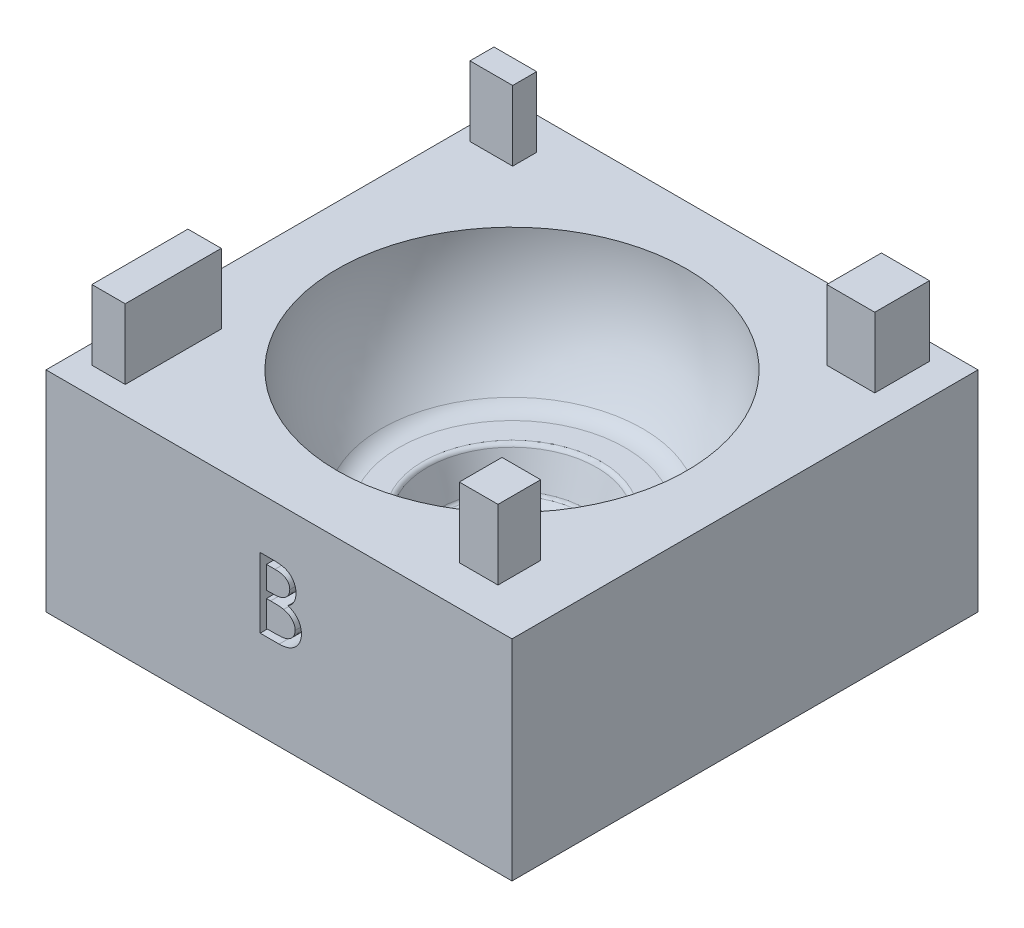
ISO-10303-21;
HEADER;
FILE_DESCRIPTION(('STEP AP214'),'2;1');
FILE_NAME('part.step','',(''),(''),'','','');
FILE_SCHEMA(('AUTOMOTIVE_DESIGN { 1 0 10303 214 1 1 1 1 }'));
ENDSEC;
DATA;
#1=APPLICATION_CONTEXT('core data for automotive mechanical design processes');
#2=APPLICATION_PROTOCOL_DEFINITION('international standard','automotive_design',2000,#1);
#3=PRODUCT_CONTEXT('',#1,'mechanical');
#4=PRODUCT('Part','Part','',(#3));
#5=PRODUCT_RELATED_PRODUCT_CATEGORY('part','',(#4));
#6=PRODUCT_DEFINITION_FORMATION('','',#4);
#7=PRODUCT_DEFINITION_CONTEXT('part definition',#1,'design');
#8=PRODUCT_DEFINITION('design','',#6,#7);
#9=PRODUCT_DEFINITION_SHAPE('','',#8);
#10=(LENGTH_UNIT() NAMED_UNIT(*) SI_UNIT(.MILLI.,.METRE.));
#11=(NAMED_UNIT(*) PLANE_ANGLE_UNIT() SI_UNIT($,.RADIAN.));
#12=(NAMED_UNIT(*) SI_UNIT($,.STERADIAN.) SOLID_ANGLE_UNIT());
#13=UNCERTAINTY_MEASURE_WITH_UNIT(LENGTH_MEASURE(1.E-05),#10,'distance_accuracy_value','');
#14=(GEOMETRIC_REPRESENTATION_CONTEXT(3) GLOBAL_UNCERTAINTY_ASSIGNED_CONTEXT((#13)) GLOBAL_UNIT_ASSIGNED_CONTEXT((#10,
#11,#12)) REPRESENTATION_CONTEXT('',''));
#15=CARTESIAN_POINT('',(0.,0.,0.));
#16=DIRECTION('',(0.,0.,1.));
#17=DIRECTION('',(1.,0.,0.));
#18=AXIS2_PLACEMENT_3D('',#15,#16,#17);
#19=CARTESIAN_POINT('',(-50.,-45.,50.));
#20=DIRECTION('',(0.,0.,1.));
#21=DIRECTION('',(1.,0.,0.));
#22=AXIS2_PLACEMENT_3D('',#19,#20,#21);
#23=PLANE('',#22);
#24=DIRECTION('',(1.,0.,0.));
#25=VECTOR('',#24,1.);
#26=CARTESIAN_POINT('',(-50.,0.,50.));
#27=LINE('',#26,#25);
#28=CARTESIAN_POINT('',(-50.,0.,50.));
#29=VERTEX_POINT('',#28);
#30=CARTESIAN_POINT('',(50.,0.,50.));
#31=VERTEX_POINT('',#30);
#32=EDGE_CURVE('E568',#29,#31,#27,.T.);
#33=ORIENTED_EDGE('',*,*,#32,.F.);
#34=DIRECTION('',(0.,1.,0.));
#35=VECTOR('',#34,1.);
#36=CARTESIAN_POINT('',(-50.,-45.,50.));
#37=LINE('',#36,#35);
#38=CARTESIAN_POINT('',(-50.,-45.,50.));
#39=VERTEX_POINT('',#38);
#40=EDGE_CURVE('E48',#39,#29,#37,.T.);
#41=ORIENTED_EDGE('',*,*,#40,.F.);
#42=DIRECTION('',(1.,0.,0.));
#43=VECTOR('',#42,1.);
#44=CARTESIAN_POINT('',(-50.,-45.,50.));
#45=LINE('',#44,#43);
#46=CARTESIAN_POINT('',(50.,-45.,50.));
#47=VERTEX_POINT('',#46);
#48=EDGE_CURVE('E576',#39,#47,#45,.T.);
#49=ORIENTED_EDGE('',*,*,#48,.T.);
#50=DIRECTION('',(0.,1.,0.));
#51=VECTOR('',#50,1.);
#52=CARTESIAN_POINT('',(50.,-45.,50.));
#53=LINE('',#52,#51);
#54=EDGE_CURVE('E11',#47,#31,#53,.T.);
#55=ORIENTED_EDGE('',*,*,#54,.T.);
#56=EDGE_LOOP('',(#33,#41,#49,#55));
#57=FACE_BOUND('',#56,.T.);
#58=DIRECTION('',(-1.,0.,0.));
#59=VECTOR('',#58,1.);
#60=CARTESIAN_POINT('',(0.0180288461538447,-25.9558667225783,50.));
#61=LINE('',#60,#59);
#62=CARTESIAN_POINT('',(0.0180288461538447,-25.9558667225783,50.));
#63=VERTEX_POINT('',#62);
#64=CARTESIAN_POINT('',(-4.03846153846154,-25.9558667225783,50.));
#65=VERTEX_POINT('',#64);
#66=EDGE_CURVE('E420',#63,#65,#61,.T.);
#67=ORIENTED_EDGE('',*,*,#66,.T.);
#68=DIRECTION('',(0.,1.,0.));
#69=VECTOR('',#68,1.);
#70=CARTESIAN_POINT('',(-4.03846153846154,-25.9558667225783,50.));
#71=LINE('',#70,#69);
#72=CARTESIAN_POINT('',(-4.03846153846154,-10.9558667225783,50.));
#73=VERTEX_POINT('',#72);
#74=EDGE_CURVE('E56',#65,#73,#71,.T.);
#75=ORIENTED_EDGE('',*,*,#74,.T.);
#76=DIRECTION('',(1.,0.,0.));
#77=VECTOR('',#76,1.);
#78=CARTESIAN_POINT('',(-4.03846153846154,-10.9558667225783,50.));
#79=LINE('',#78,#77);
#80=CARTESIAN_POINT('',(-1.11177884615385,-10.9558667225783,50.));
#81=VERTEX_POINT('',#80);
#82=EDGE_CURVE('E767',#73,#81,#79,.T.);
#83=ORIENTED_EDGE('',*,*,#82,.T.);
#84=CARTESIAN_POINT('',(-1.11177884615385,-10.9558667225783,50.));
#85=CARTESIAN_POINT('',(-0.968513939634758,-10.9566199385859,50.));
#86=CARTESIAN_POINT('',(-0.690830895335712,-10.9580798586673,50.));
#87=CARTESIAN_POINT('',(-0.287033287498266,-10.9807218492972,50.));
#88=CARTESIAN_POINT('',(0.0911759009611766,-11.0115947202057,50.));
#89=CARTESIAN_POINT('',(0.443906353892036,-11.060580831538,50.));
#90=CARTESIAN_POINT('',(0.770995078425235,-11.1196884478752,50.));
#91=CARTESIAN_POINT('',(1.07342780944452,-11.1912676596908,50.));
#92=CARTESIAN_POINT('',(1.35024283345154,-11.2770960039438,50.));
#93=CARTESIAN_POINT('',(1.68072598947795,-11.4135800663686,50.));
#94=CARTESIAN_POINT('',(2.05752882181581,-11.6163936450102,50.));
#95=CARTESIAN_POINT('',(2.46552193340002,-11.9160874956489,50.));
#96=CARTESIAN_POINT('',(2.81439724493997,-12.2826551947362,50.));
#97=CARTESIAN_POINT('',(3.11519574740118,-12.6961522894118,50.));
#98=CARTESIAN_POINT('',(3.35434340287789,-13.1510198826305,50.));
#99=CARTESIAN_POINT('',(3.527354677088,-13.6364164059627,50.));
#100=CARTESIAN_POINT('',(3.6368884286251,-14.1460810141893,50.));
#101=CARTESIAN_POINT('',(3.64815314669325,-14.4959803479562,50.));
#102=CARTESIAN_POINT('',(3.65384615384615,-14.6728138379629,50.));
#103=B_SPLINE_CURVE_WITH_KNOTS('',3,(#84,#85,#86,#87,#88,#89,#90,#91,#92,#93,#94,#95,#96,#97,
#98,#99,#100,#101,#102),.UNSPECIFIED.,.F.,.F.,(4,1,1,1,1,1,1,1,1,1,1,1,1,1,1,1,4),(0.,
0.0625940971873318,0.12132293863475,0.176680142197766,0.228365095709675,0.276868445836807,
0.321879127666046,0.364098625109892,0.403355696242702,0.477967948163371,0.550535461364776,
0.623584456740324,0.698174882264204,0.773353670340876,0.847281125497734,0.92281833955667,1.),.UNSPECIFIED.);
#104=CARTESIAN_POINT('',(3.65384615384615,-14.6728138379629,50.));
#105=VERTEX_POINT('',#104);
#106=EDGE_CURVE('E759',#81,#105,#103,.T.);
#107=ORIENTED_EDGE('',*,*,#106,.T.);
#108=CARTESIAN_POINT('',(3.65384615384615,-14.6728138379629,50.));
#109=CARTESIAN_POINT('',(3.64916093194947,-14.8384676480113,50.));
#110=CARTESIAN_POINT('',(3.63995402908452,-15.1639930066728,50.));
#111=CARTESIAN_POINT('',(3.55191363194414,-15.6401106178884,50.));
#112=CARTESIAN_POINT('',(3.41408219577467,-16.0933301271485,50.));
#113=CARTESIAN_POINT('',(3.22248827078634,-16.5219974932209,50.));
#114=CARTESIAN_POINT('',(2.97347971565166,-16.9164272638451,50.));
#115=CARTESIAN_POINT('',(2.67837263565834,-17.279801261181,50.));
#116=CARTESIAN_POINT('',(2.32232919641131,-17.596734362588,50.));
#117=CARTESIAN_POINT('',(2.05557245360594,-17.7739182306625,50.));
#118=CARTESIAN_POINT('',(1.92007211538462,-17.8639196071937,50.));
#119=B_SPLINE_CURVE_WITH_KNOTS('',3,(#108,#109,#110,#111,#112,#113,#114,#115,#116,#117,#118),
.UNSPECIFIED.,.F.,.F.,(4,1,1,1,1,1,1,1,4),(0.,0.13056910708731,0.256580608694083,
0.380551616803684,0.503622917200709,0.625739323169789,0.747548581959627,0.871766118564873,1.),.UNSPECIFIED.);
#120=CARTESIAN_POINT('',(1.92007211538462,-17.8639196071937,50.));
#121=VERTEX_POINT('',#120);
#122=EDGE_CURVE('E751',#105,#121,#119,.T.);
#123=ORIENTED_EDGE('',*,*,#122,.T.);
#124=CARTESIAN_POINT('',(1.92007211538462,-17.8639196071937,50.));
#125=CARTESIAN_POINT('',(2.09047394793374,-17.9293410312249,50.));
#126=CARTESIAN_POINT('',(2.41649486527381,-18.0545084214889,50.));
#127=CARTESIAN_POINT('',(2.86514920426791,-18.2758032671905,50.));
#128=CARTESIAN_POINT('',(3.25169853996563,-18.5164980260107,50.));
#129=CARTESIAN_POINT('',(3.57911487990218,-18.7793488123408,50.));
#130=CARTESIAN_POINT('',(3.85913340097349,-19.0626722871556,50.));
#131=CARTESIAN_POINT('',(4.10364600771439,-19.3706227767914,50.));
#132=CARTESIAN_POINT('',(4.31228046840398,-19.7072174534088,50.));
#133=CARTESIAN_POINT('',(4.49105014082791,-20.0689468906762,50.));
#134=CARTESIAN_POINT('',(4.63054480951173,-20.4521174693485,50.));
#135=CARTESIAN_POINT('',(4.73501297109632,-20.8531350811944,50.));
#136=CARTESIAN_POINT('',(4.79487346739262,-21.2705617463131,50.));
#137=CARTESIAN_POINT('',(4.80339193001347,-21.5546419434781,50.));
#138=CARTESIAN_POINT('',(4.80769230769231,-21.6980542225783,50.));
#139=B_SPLINE_CURVE_WITH_KNOTS('',3,(#124,#125,#126,#127,#128,#129,#130,#131,#132,#133,#134,
#135,#136,#137,#138),.UNSPECIFIED.,.F.,.F.,(4,1,1,1,1,1,1,1,1,1,1,1,4),(0.,0.106057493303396,
0.20291425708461,0.290300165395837,0.37022256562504,0.44638372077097,0.521396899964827,
0.598291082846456,0.676142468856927,0.755528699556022,0.834887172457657,0.916646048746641,1.),.UNSPECIFIED.);
#140=CARTESIAN_POINT('',(4.80769230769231,-21.6980542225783,50.));
#141=VERTEX_POINT('',#140);
#142=EDGE_CURVE('E743',#121,#141,#139,.T.);
#143=ORIENTED_EDGE('',*,*,#142,.T.);
#144=CARTESIAN_POINT('',(4.80769230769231,-21.6980542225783,50.));
#145=CARTESIAN_POINT('',(4.80350582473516,-21.8444836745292,50.));
#146=CARTESIAN_POINT('',(4.79526880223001,-22.1325877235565,50.));
#147=CARTESIAN_POINT('',(4.73449749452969,-22.5558240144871,50.));
#148=CARTESIAN_POINT('',(4.63160132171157,-22.9602880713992,50.));
#149=CARTESIAN_POINT('',(4.48986783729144,-23.3485959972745,50.));
#150=CARTESIAN_POINT('',(4.30488648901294,-23.7199965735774,50.));
#151=CARTESIAN_POINT('',(4.07976664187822,-24.074910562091,50.));
#152=CARTESIAN_POINT('',(3.81134565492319,-24.4097719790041,50.));
#153=CARTESIAN_POINT('',(3.51107621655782,-24.7283017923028,50.));
#154=CARTESIAN_POINT('',(3.17138130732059,-25.0147065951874,50.));
#155=CARTESIAN_POINT('',(2.80488521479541,-25.269773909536,50.));
#156=CARTESIAN_POINT('',(2.40697241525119,-25.4795427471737,50.));
#157=CARTESIAN_POINT('',(1.9841781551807,-25.6557542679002,50.));
#158=CARTESIAN_POINT('',(1.53175965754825,-25.7903565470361,50.));
#159=CARTESIAN_POINT('',(1.05174848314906,-25.8845247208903,50.));
#160=CARTESIAN_POINT('',(0.544558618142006,-25.9479748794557,50.));
#161=CARTESIAN_POINT('',(0.196516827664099,-25.9531914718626,50.));
#162=CARTESIAN_POINT('',(0.0180288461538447,-25.9558667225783,50.));
#163=B_SPLINE_CURVE_WITH_KNOTS('',3,(#144,#145,#146,#147,#148,#149,#150,#151,#152,#153,#154,
#155,#156,#157,#158,#159,#160,#161,#162),.UNSPECIFIED.,.F.,.F.,(4,1,1,1,1,1,1,1,1,1,1,1,1,1,1,1,
4),(0.,0.0611602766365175,0.120334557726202,0.178180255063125,0.235235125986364,
0.29268296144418,0.351186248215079,0.410456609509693,0.471719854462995,0.533761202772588,
0.595739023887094,0.657887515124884,0.721295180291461,0.786822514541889,0.854686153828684,
0.925477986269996,1.),.UNSPECIFIED.);
#164=EDGE_CURVE('E738',#141,#63,#163,.T.);
#165=ORIENTED_EDGE('',*,*,#164,.T.);
#166=EDGE_LOOP('',(#67,#75,#83,#107,#123,#143,#165));
#167=FACE_BOUND('',#166,.T.);
#168=ADVANCED_FACE('F39',(#57,#167),#23,.T.);
#169=CARTESIAN_POINT('',(0.,0.,0.));
#170=DIRECTION('',(0.,-1.,0.));
#171=DIRECTION('',(0.,0.,-1.));
#172=AXIS2_PLACEMENT_3D('',#169,#170,#171);
#173=PLANE('',#172);
#174=CARTESIAN_POINT('',(0.,0.,0.));
#175=DIRECTION('',(0.,-1.,0.));
#176=DIRECTION('',(0.,0.,-1.));
#177=AXIS2_PLACEMENT_3D('',#174,#175,#176);
#178=CIRCLE('',#177,37.5);
#179=CARTESIAN_POINT('',(0.,0.,-37.5));
#180=VERTEX_POINT('',#179);
#181=EDGE_CURVE('E43',#180,#180,#178,.T.);
#182=ORIENTED_EDGE('',*,*,#181,.T.);
#183=EDGE_LOOP('',(#182));
#184=FACE_BOUND('',#183,.T.);
#185=DIRECTION('',(0.,0.,-1.));
#186=VECTOR('',#185,1.);
#187=CARTESIAN_POINT('',(-38.780021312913,0.,23.611452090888));
#188=LINE('',#187,#186);
#189=CARTESIAN_POINT('',(-38.780021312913,0.,44.2178102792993));
#190=VERTEX_POINT('',#189);
#191=CARTESIAN_POINT('',(-38.780021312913,0.,23.611452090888));
#192=VERTEX_POINT('',#191);
#193=EDGE_CURVE('E678',#190,#192,#188,.T.);
#194=ORIENTED_EDGE('',*,*,#193,.F.);
#195=DIRECTION('',(1.,0.,0.));
#196=VECTOR('',#195,1.);
#197=CARTESIAN_POINT('',(-45.9350067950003,0.,44.2178102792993));
#198=LINE('',#197,#196);
#199=CARTESIAN_POINT('',(-45.9350067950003,0.,44.2178102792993));
#200=VERTEX_POINT('',#199);
#201=EDGE_CURVE('E668',#200,#190,#198,.T.);
#202=ORIENTED_EDGE('',*,*,#201,.F.);
#203=DIRECTION('',(0.,0.,1.));
#204=VECTOR('',#203,1.);
#205=CARTESIAN_POINT('',(-45.9350067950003,0.,23.611452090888));
#206=LINE('',#205,#204);
#207=CARTESIAN_POINT('',(-45.9350067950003,0.,23.611452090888));
#208=VERTEX_POINT('',#207);
#209=EDGE_CURVE('E672',#208,#200,#206,.T.);
#210=ORIENTED_EDGE('',*,*,#209,.F.);
#211=DIRECTION('',(-1.,0.,0.));
#212=VECTOR('',#211,1.);
#213=CARTESIAN_POINT('',(-45.9350067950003,0.,23.611452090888));
#214=LINE('',#213,#212);
#215=EDGE_CURVE('E675',#192,#208,#214,.T.);
#216=ORIENTED_EDGE('',*,*,#215,.F.);
#217=EDGE_LOOP('',(#194,#202,#210,#216));
#218=FACE_BOUND('',#217,.T.);
#219=DIRECTION('',(0.,0.,-1.));
#220=VECTOR('',#219,1.);
#221=CARTESIAN_POINT('',(-37.7783233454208,0.,-43.0730126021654));
#222=LINE('',#221,#220);
#223=CARTESIAN_POINT('',(-37.7783233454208,0.,-37.9214230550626));
#224=VERTEX_POINT('',#223);
#225=CARTESIAN_POINT('',(-37.7783233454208,0.,-43.0730126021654));
#226=VERTEX_POINT('',#225);
#227=EDGE_CURVE('E612',#224,#226,#222,.T.);
#228=ORIENTED_EDGE('',*,*,#227,.F.);
#229=DIRECTION('',(1.,0.,0.));
#230=VECTOR('',#229,1.);
#231=CARTESIAN_POINT('',(-46.9367047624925,0.,-37.9214230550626));
#232=LINE('',#231,#230);
#233=CARTESIAN_POINT('',(-46.9367047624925,0.,-37.9214230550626));
#234=VERTEX_POINT('',#233);
#235=EDGE_CURVE('E602',#234,#224,#232,.T.);
#236=ORIENTED_EDGE('',*,*,#235,.F.);
#237=DIRECTION('',(0.,0.,1.));
#238=VECTOR('',#237,1.);
#239=CARTESIAN_POINT('',(-46.9367047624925,0.,-43.0730126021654));
#240=LINE('',#239,#238);
#241=CARTESIAN_POINT('',(-46.9367047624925,0.,-43.0730126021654));
#242=VERTEX_POINT('',#241);
#243=EDGE_CURVE('E606',#242,#234,#240,.T.);
#244=ORIENTED_EDGE('',*,*,#243,.F.);
#245=DIRECTION('',(-1.,0.,0.));
#246=VECTOR('',#245,1.);
#247=CARTESIAN_POINT('',(-46.9367047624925,0.,-43.0730126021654));
#248=LINE('',#247,#246);
#249=EDGE_CURVE('E609',#226,#242,#248,.T.);
#250=ORIENTED_EDGE('',*,*,#249,.F.);
#251=EDGE_LOOP('',(#228,#236,#244,#250));
#252=FACE_BOUND('',#251,.T.);
#253=DIRECTION('',(0.,0.,-1.));
#254=VECTOR('',#253,1.);
#255=CARTESIAN_POINT('',(50.,0.,50.));
#256=LINE('',#255,#254);
#257=CARTESIAN_POINT('',(50.,0.,-50.));
#258=VERTEX_POINT('',#257);
#259=EDGE_CURVE('E562',#31,#258,#256,.T.);
#260=ORIENTED_EDGE('',*,*,#259,.T.);
#261=DIRECTION('',(-1.,0.,0.));
#262=VECTOR('',#261,1.);
#263=CARTESIAN_POINT('',(-50.,0.,-50.));
#264=LINE('',#263,#262);
#265=CARTESIAN_POINT('',(-50.,0.,-50.));
#266=VERTEX_POINT('',#265);
#267=EDGE_CURVE('E552',#258,#266,#264,.T.);
#268=ORIENTED_EDGE('',*,*,#267,.T.);
#269=DIRECTION('',(0.,0.,1.));
#270=VECTOR('',#269,1.);
#271=CARTESIAN_POINT('',(-50.,0.,50.));
#272=LINE('',#271,#270);
#273=EDGE_CURVE('E561',#266,#29,#272,.T.);
#274=ORIENTED_EDGE('',*,*,#273,.T.);
#275=ORIENTED_EDGE('',*,*,#32,.T.);
#276=EDGE_LOOP('',(#260,#268,#274,#275));
#277=FACE_BOUND('',#276,.T.);
#278=DIRECTION('',(0.,0.,-1.));
#279=VECTOR('',#278,1.);
#280=CARTESIAN_POINT('',(43.2161123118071,0.,-46.3643059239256));
#281=LINE('',#280,#279);
#282=CARTESIAN_POINT('',(43.2161123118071,0.,-34.6301297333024));
#283=VERTEX_POINT('',#282);
#284=CARTESIAN_POINT('',(43.2161123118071,0.,-46.3643059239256));
#285=VERTEX_POINT('',#284);
#286=EDGE_CURVE('E645',#283,#285,#281,.T.);
#287=ORIENTED_EDGE('',*,*,#286,.F.);
#288=DIRECTION('',(1.,0.,0.));
#289=VECTOR('',#288,1.);
#290=CARTESIAN_POINT('',(32.9129332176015,0.,-34.6301297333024));
#291=LINE('',#290,#289);
#292=CARTESIAN_POINT('',(32.9129332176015,0.,-34.6301297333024));
#293=VERTEX_POINT('',#292);
#294=EDGE_CURVE('E635',#293,#283,#291,.T.);
#295=ORIENTED_EDGE('',*,*,#294,.F.);
#296=DIRECTION('',(0.,0.,1.));
#297=VECTOR('',#296,1.);
#298=CARTESIAN_POINT('',(32.9129332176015,0.,-46.3643059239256));
#299=LINE('',#298,#297);
#300=CARTESIAN_POINT('',(32.9129332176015,0.,-46.3643059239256));
#301=VERTEX_POINT('',#300);
#302=EDGE_CURVE('E639',#301,#293,#299,.T.);
#303=ORIENTED_EDGE('',*,*,#302,.F.);
#304=DIRECTION('',(-1.,0.,0.));
#305=VECTOR('',#304,1.);
#306=CARTESIAN_POINT('',(32.9129332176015,0.,-46.3643059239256));
#307=LINE('',#306,#305);
#308=EDGE_CURVE('E642',#285,#301,#307,.T.);
#309=ORIENTED_EDGE('',*,*,#308,.F.);
#310=EDGE_LOOP('',(#287,#295,#303,#309));
#311=FACE_BOUND('',#310,.T.);
#312=DIRECTION('',(0.,0.,1.));
#313=VECTOR('',#312,1.);
#314=CARTESIAN_POINT('',(30.1940387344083,0.,32.3405343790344));
#315=LINE('',#314,#313);
#316=CARTESIAN_POINT('',(30.1940387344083,0.,32.3405343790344));
#317=VERTEX_POINT('',#316);
#318=CARTESIAN_POINT('',(30.1940387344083,0.,41.4989157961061));
#319=VERTEX_POINT('',#318);
#320=EDGE_CURVE('E711',#317,#319,#315,.T.);
#321=ORIENTED_EDGE('',*,*,#320,.F.);
#322=DIRECTION('',(-1.,0.,0.));
#323=VECTOR('',#322,1.);
#324=CARTESIAN_POINT('',(38.4938218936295,0.,32.3405343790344));
#325=LINE('',#324,#323);
#326=CARTESIAN_POINT('',(38.4938218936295,0.,32.3405343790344));
#327=VERTEX_POINT('',#326);
#328=EDGE_CURVE('E701',#327,#317,#325,.T.);
#329=ORIENTED_EDGE('',*,*,#328,.F.);
#330=DIRECTION('',(0.,0.,-1.));
#331=VECTOR('',#330,1.);
#332=CARTESIAN_POINT('',(38.4938218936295,0.,32.3405343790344));
#333=LINE('',#332,#331);
#334=CARTESIAN_POINT('',(38.4938218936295,0.,41.4989157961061));
#335=VERTEX_POINT('',#334);
#336=EDGE_CURVE('E705',#335,#327,#333,.T.);
#337=ORIENTED_EDGE('',*,*,#336,.F.);
#338=DIRECTION('',(1.,0.,0.));
#339=VECTOR('',#338,1.);
#340=CARTESIAN_POINT('',(38.4938218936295,0.,41.4989157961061));
#341=LINE('',#340,#339);
#342=EDGE_CURVE('E708',#319,#335,#341,.T.);
#343=ORIENTED_EDGE('',*,*,#342,.F.);
#344=EDGE_LOOP('',(#321,#329,#337,#343));
#345=FACE_BOUND('',#344,.T.);
#346=ADVANCED_FACE('F535',(#184,#218,#252,#277,#311,#345),#173,.F.);
#347=CARTESIAN_POINT('',(50.,-45.,50.));
#348=DIRECTION('',(1.,0.,0.));
#349=DIRECTION('',(0.,0.,-1.));
#350=AXIS2_PLACEMENT_3D('',#347,#348,#349);
#351=PLANE('',#350);
#352=ORIENTED_EDGE('',*,*,#259,.F.);
#353=ORIENTED_EDGE('',*,*,#54,.F.);
#354=DIRECTION('',(0.,0.,-1.));
#355=VECTOR('',#354,1.);
#356=CARTESIAN_POINT('',(50.,-45.,50.));
#357=LINE('',#356,#355);
#358=CARTESIAN_POINT('',(50.,-45.,-50.));
#359=VERTEX_POINT('',#358);
#360=EDGE_CURVE('E580',#47,#359,#357,.T.);
#361=ORIENTED_EDGE('',*,*,#360,.T.);
#362=DIRECTION('',(0.,1.,0.));
#363=VECTOR('',#362,1.);
#364=CARTESIAN_POINT('',(50.,-45.,-50.));
#365=LINE('',#364,#363);
#366=EDGE_CURVE('E555',#359,#258,#365,.T.);
#367=ORIENTED_EDGE('',*,*,#366,.T.);
#368=EDGE_LOOP('',(#352,#353,#361,#367));
#369=FACE_BOUND('',#368,.T.);
#370=ADVANCED_FACE('F41',(#369),#351,.T.);
#371=CARTESIAN_POINT('',(-50.,-45.,50.));
#372=DIRECTION('',(-1.,0.,0.));
#373=DIRECTION('',(0.,0.,1.));
#374=AXIS2_PLACEMENT_3D('',#371,#372,#373);
#375=PLANE('',#374);
#376=ORIENTED_EDGE('',*,*,#273,.F.);
#377=DIRECTION('',(0.,1.,0.));
#378=VECTOR('',#377,1.);
#379=CARTESIAN_POINT('',(-50.,-45.,-50.));
#380=LINE('',#379,#378);
#381=CARTESIAN_POINT('',(-50.,-45.,-50.));
#382=VERTEX_POINT('',#381);
#383=EDGE_CURVE('E557',#382,#266,#380,.T.);
#384=ORIENTED_EDGE('',*,*,#383,.F.);
#385=DIRECTION('',(0.,0.,1.));
#386=VECTOR('',#385,1.);
#387=CARTESIAN_POINT('',(-50.,-45.,50.));
#388=LINE('',#387,#386);
#389=EDGE_CURVE('E585',#382,#39,#388,.T.);
#390=ORIENTED_EDGE('',*,*,#389,.T.);
#391=ORIENTED_EDGE('',*,*,#40,.T.);
#392=EDGE_LOOP('',(#376,#384,#390,#391));
#393=FACE_BOUND('',#392,.T.);
#394=ADVANCED_FACE('F543',(#393),#375,.T.);
#395=CARTESIAN_POINT('',(-50.,-45.,-50.));
#396=DIRECTION('',(0.,0.,-1.));
#397=DIRECTION('',(-1.,0.,0.));
#398=AXIS2_PLACEMENT_3D('',#395,#396,#397);
#399=PLANE('',#398);
#400=ORIENTED_EDGE('',*,*,#267,.F.);
#401=ORIENTED_EDGE('',*,*,#366,.F.);
#402=DIRECTION('',(-1.,0.,0.));
#403=VECTOR('',#402,1.);
#404=CARTESIAN_POINT('',(-50.,-45.,-50.));
#405=LINE('',#404,#403);
#406=EDGE_CURVE('E588',#359,#382,#405,.T.);
#407=ORIENTED_EDGE('',*,*,#406,.T.);
#408=ORIENTED_EDGE('',*,*,#383,.T.);
#409=EDGE_LOOP('',(#400,#401,#407,#408));
#410=FACE_BOUND('',#409,.T.);
#411=ADVANCED_FACE('F533',(#410),#399,.T.);
#412=CARTESIAN_POINT('',(0.,-45.,0.));
#413=DIRECTION('',(0.,-1.,0.));
#414=DIRECTION('',(0.,0.,-1.));
#415=AXIS2_PLACEMENT_3D('',#412,#413,#414);
#416=PLANE('',#415);
#417=ORIENTED_EDGE('',*,*,#360,.F.);
#418=ORIENTED_EDGE('',*,*,#48,.F.);
#419=ORIENTED_EDGE('',*,*,#389,.F.);
#420=ORIENTED_EDGE('',*,*,#406,.F.);
#421=EDGE_LOOP('',(#417,#418,#419,#420));
#422=FACE_BOUND('',#421,.T.);
#423=ADVANCED_FACE('F529',(#422),#416,.T.);
#424=CARTESIAN_POINT('',(-37.7783233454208,15.,-43.0730126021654));
#425=DIRECTION('',(-1.,0.,0.));
#426=DIRECTION('',(0.,0.,1.));
#427=AXIS2_PLACEMENT_3D('',#424,#425,#426);
#428=PLANE('',#427);
#429=ORIENTED_EDGE('',*,*,#227,.T.);
#430=DIRECTION('',(0.,-1.,0.));
#431=VECTOR('',#430,1.);
#432=CARTESIAN_POINT('',(-37.7783233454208,15.,-43.0730126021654));
#433=LINE('',#432,#431);
#434=CARTESIAN_POINT('',(-37.7783233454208,15.,-43.0730126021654));
#435=VERTEX_POINT('',#434);
#436=EDGE_CURVE('E570',#435,#226,#433,.T.);
#437=ORIENTED_EDGE('',*,*,#436,.F.);
#438=DIRECTION('',(0.,0.,-1.));
#439=VECTOR('',#438,1.);
#440=CARTESIAN_POINT('',(-37.7783233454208,15.,-43.0730126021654));
#441=LINE('',#440,#439);
#442=CARTESIAN_POINT('',(-37.7783233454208,15.,-37.9214230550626));
#443=VERTEX_POINT('',#442);
#444=EDGE_CURVE('E605',#443,#435,#441,.T.);
#445=ORIENTED_EDGE('',*,*,#444,.F.);
#446=DIRECTION('',(0.,-1.,0.));
#447=VECTOR('',#446,1.);
#448=CARTESIAN_POINT('',(-37.7783233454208,15.,-37.9214230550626));
#449=LINE('',#448,#447);
#450=EDGE_CURVE('E598',#443,#224,#449,.T.);
#451=ORIENTED_EDGE('',*,*,#450,.T.);
#452=EDGE_LOOP('',(#429,#437,#445,#451));
#453=FACE_BOUND('',#452,.T.);
#454=ADVANCED_FACE('F525',(#453),#428,.F.);
#455=CARTESIAN_POINT('',(-46.9367047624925,15.,-43.0730126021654));
#456=DIRECTION('',(0.,0.,1.));
#457=DIRECTION('',(1.,0.,0.));
#458=AXIS2_PLACEMENT_3D('',#455,#456,#457);
#459=PLANE('',#458);
#460=ORIENTED_EDGE('',*,*,#249,.T.);
#461=DIRECTION('',(0.,-1.,0.));
#462=VECTOR('',#461,1.);
#463=CARTESIAN_POINT('',(-46.9367047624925,15.,-43.0730126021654));
#464=LINE('',#463,#462);
#465=CARTESIAN_POINT('',(-46.9367047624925,15.,-43.0730126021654));
#466=VERTEX_POINT('',#465);
#467=EDGE_CURVE('E573',#466,#242,#464,.T.);
#468=ORIENTED_EDGE('',*,*,#467,.F.);
#469=DIRECTION('',(-1.,0.,0.));
#470=VECTOR('',#469,1.);
#471=CARTESIAN_POINT('',(-46.9367047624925,15.,-43.0730126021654));
#472=LINE('',#471,#470);
#473=EDGE_CURVE('E619',#435,#466,#472,.T.);
#474=ORIENTED_EDGE('',*,*,#473,.F.);
#475=ORIENTED_EDGE('',*,*,#436,.T.);
#476=EDGE_LOOP('',(#460,#468,#474,#475));
#477=FACE_BOUND('',#476,.T.);
#478=ADVANCED_FACE('F521',(#477),#459,.F.);
#479=CARTESIAN_POINT('',(-46.9367047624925,15.,-43.0730126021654));
#480=DIRECTION('',(1.,0.,0.));
#481=DIRECTION('',(0.,0.,-1.));
#482=AXIS2_PLACEMENT_3D('',#479,#480,#481);
#483=PLANE('',#482);
#484=ORIENTED_EDGE('',*,*,#243,.T.);
#485=DIRECTION('',(0.,-1.,0.));
#486=VECTOR('',#485,1.);
#487=CARTESIAN_POINT('',(-46.9367047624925,15.,-37.9214230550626));
#488=LINE('',#487,#486);
#489=CARTESIAN_POINT('',(-46.9367047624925,15.,-37.9214230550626));
#490=VERTEX_POINT('',#489);
#491=EDGE_CURVE('E595',#490,#234,#488,.T.);
#492=ORIENTED_EDGE('',*,*,#491,.F.);
#493=DIRECTION('',(0.,0.,1.));
#494=VECTOR('',#493,1.);
#495=CARTESIAN_POINT('',(-46.9367047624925,15.,-43.0730126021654));
#496=LINE('',#495,#494);
#497=EDGE_CURVE('E617',#466,#490,#496,.T.);
#498=ORIENTED_EDGE('',*,*,#497,.F.);
#499=ORIENTED_EDGE('',*,*,#467,.T.);
#500=EDGE_LOOP('',(#484,#492,#498,#499));
#501=FACE_BOUND('',#500,.T.);
#502=ADVANCED_FACE('F517',(#501),#483,.F.);
#503=CARTESIAN_POINT('',(-46.9367047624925,15.,-37.9214230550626));
#504=DIRECTION('',(0.,0.,-1.));
#505=DIRECTION('',(-1.,0.,0.));
#506=AXIS2_PLACEMENT_3D('',#503,#504,#505);
#507=PLANE('',#506);
#508=ORIENTED_EDGE('',*,*,#235,.T.);
#509=ORIENTED_EDGE('',*,*,#450,.F.);
#510=DIRECTION('',(1.,0.,0.));
#511=VECTOR('',#510,1.);
#512=CARTESIAN_POINT('',(-46.9367047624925,15.,-37.9214230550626));
#513=LINE('',#512,#511);
#514=EDGE_CURVE('E601',#490,#443,#513,.T.);
#515=ORIENTED_EDGE('',*,*,#514,.F.);
#516=ORIENTED_EDGE('',*,*,#491,.T.);
#517=EDGE_LOOP('',(#508,#509,#515,#516));
#518=FACE_BOUND('',#517,.T.);
#519=ADVANCED_FACE('F513',(#518),#507,.F.);
#520=CARTESIAN_POINT('',(0.,15.,0.));
#521=DIRECTION('',(0.,1.,0.));
#522=DIRECTION('',(0.,0.,1.));
#523=AXIS2_PLACEMENT_3D('',#520,#521,#522);
#524=PLANE('',#523);
#525=ORIENTED_EDGE('',*,*,#444,.T.);
#526=ORIENTED_EDGE('',*,*,#473,.T.);
#527=ORIENTED_EDGE('',*,*,#497,.T.);
#528=ORIENTED_EDGE('',*,*,#514,.T.);
#529=EDGE_LOOP('',(#525,#526,#527,#528));
#530=FACE_BOUND('',#529,.T.);
#531=ADVANCED_FACE('F509',(#530),#524,.T.);
#532=CARTESIAN_POINT('',(43.2161123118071,15.,-46.3643059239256));
#533=DIRECTION('',(-1.,0.,0.));
#534=DIRECTION('',(0.,0.,1.));
#535=AXIS2_PLACEMENT_3D('',#532,#533,#534);
#536=PLANE('',#535);
#537=ORIENTED_EDGE('',*,*,#286,.T.);
#538=DIRECTION('',(0.,-1.,0.));
#539=VECTOR('',#538,1.);
#540=CARTESIAN_POINT('',(43.2161123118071,15.,-46.3643059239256));
#541=LINE('',#540,#539);
#542=CARTESIAN_POINT('',(43.2161123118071,15.,-46.3643059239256));
#543=VERTEX_POINT('',#542);
#544=EDGE_CURVE('E615',#543,#285,#541,.T.);
#545=ORIENTED_EDGE('',*,*,#544,.F.);
#546=DIRECTION('',(0.,0.,-1.));
#547=VECTOR('',#546,1.);
#548=CARTESIAN_POINT('',(43.2161123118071,15.,-46.3643059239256));
#549=LINE('',#548,#547);
#550=CARTESIAN_POINT('',(43.2161123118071,15.,-34.6301297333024));
#551=VERTEX_POINT('',#550);
#552=EDGE_CURVE('E638',#551,#543,#549,.T.);
#553=ORIENTED_EDGE('',*,*,#552,.F.);
#554=DIRECTION('',(0.,-1.,0.));
#555=VECTOR('',#554,1.);
#556=CARTESIAN_POINT('',(43.2161123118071,15.,-34.6301297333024));
#557=LINE('',#556,#555);
#558=EDGE_CURVE('E631',#551,#283,#557,.T.);
#559=ORIENTED_EDGE('',*,*,#558,.T.);
#560=EDGE_LOOP('',(#537,#545,#553,#559));
#561=FACE_BOUND('',#560,.T.);
#562=ADVANCED_FACE('F505',(#561),#536,.F.);
#563=CARTESIAN_POINT('',(32.9129332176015,15.,-46.3643059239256));
#564=DIRECTION('',(0.,0.,1.));
#565=DIRECTION('',(1.,0.,0.));
#566=AXIS2_PLACEMENT_3D('',#563,#564,#565);
#567=PLANE('',#566);
#568=ORIENTED_EDGE('',*,*,#308,.T.);
#569=DIRECTION('',(0.,-1.,0.));
#570=VECTOR('',#569,1.);
#571=CARTESIAN_POINT('',(32.9129332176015,15.,-46.3643059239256));
#572=LINE('',#571,#570);
#573=CARTESIAN_POINT('',(32.9129332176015,15.,-46.3643059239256));
#574=VERTEX_POINT('',#573);
#575=EDGE_CURVE('E625',#574,#301,#572,.T.);
#576=ORIENTED_EDGE('',*,*,#575,.F.);
#577=DIRECTION('',(-1.,0.,0.));
#578=VECTOR('',#577,1.);
#579=CARTESIAN_POINT('',(32.9129332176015,15.,-46.3643059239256));
#580=LINE('',#579,#578);
#581=EDGE_CURVE('E652',#543,#574,#580,.T.);
#582=ORIENTED_EDGE('',*,*,#581,.F.);
#583=ORIENTED_EDGE('',*,*,#544,.T.);
#584=EDGE_LOOP('',(#568,#576,#582,#583));
#585=FACE_BOUND('',#584,.T.);
#586=ADVANCED_FACE('F501',(#585),#567,.F.);
#587=CARTESIAN_POINT('',(32.9129332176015,15.,-46.3643059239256));
#588=DIRECTION('',(1.,0.,0.));
#589=DIRECTION('',(0.,0.,-1.));
#590=AXIS2_PLACEMENT_3D('',#587,#588,#589);
#591=PLANE('',#590);
#592=ORIENTED_EDGE('',*,*,#302,.T.);
#593=DIRECTION('',(0.,-1.,0.));
#594=VECTOR('',#593,1.);
#595=CARTESIAN_POINT('',(32.9129332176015,15.,-34.6301297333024));
#596=LINE('',#595,#594);
#597=CARTESIAN_POINT('',(32.9129332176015,15.,-34.6301297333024));
#598=VERTEX_POINT('',#597);
#599=EDGE_CURVE('E628',#598,#293,#596,.T.);
#600=ORIENTED_EDGE('',*,*,#599,.F.);
#601=DIRECTION('',(0.,0.,1.));
#602=VECTOR('',#601,1.);
#603=CARTESIAN_POINT('',(32.9129332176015,15.,-46.3643059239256));
#604=LINE('',#603,#602);
#605=EDGE_CURVE('E650',#574,#598,#604,.T.);
#606=ORIENTED_EDGE('',*,*,#605,.F.);
#607=ORIENTED_EDGE('',*,*,#575,.T.);
#608=EDGE_LOOP('',(#592,#600,#606,#607));
#609=FACE_BOUND('',#608,.T.);
#610=ADVANCED_FACE('F497',(#609),#591,.F.);
#611=CARTESIAN_POINT('',(32.9129332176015,15.,-34.6301297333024));
#612=DIRECTION('',(0.,0.,-1.));
#613=DIRECTION('',(-1.,0.,0.));
#614=AXIS2_PLACEMENT_3D('',#611,#612,#613);
#615=PLANE('',#614);
#616=ORIENTED_EDGE('',*,*,#294,.T.);
#617=ORIENTED_EDGE('',*,*,#558,.F.);
#618=DIRECTION('',(1.,0.,0.));
#619=VECTOR('',#618,1.);
#620=CARTESIAN_POINT('',(32.9129332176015,15.,-34.6301297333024));
#621=LINE('',#620,#619);
#622=EDGE_CURVE('E634',#598,#551,#621,.T.);
#623=ORIENTED_EDGE('',*,*,#622,.F.);
#624=ORIENTED_EDGE('',*,*,#599,.T.);
#625=EDGE_LOOP('',(#616,#617,#623,#624));
#626=FACE_BOUND('',#625,.T.);
#627=ADVANCED_FACE('F493',(#626),#615,.F.);
#628=CARTESIAN_POINT('',(0.,15.,0.));
#629=DIRECTION('',(0.,1.,0.));
#630=DIRECTION('',(0.,0.,1.));
#631=AXIS2_PLACEMENT_3D('',#628,#629,#630);
#632=PLANE('',#631);
#633=ORIENTED_EDGE('',*,*,#552,.T.);
#634=ORIENTED_EDGE('',*,*,#581,.T.);
#635=ORIENTED_EDGE('',*,*,#605,.T.);
#636=ORIENTED_EDGE('',*,*,#622,.T.);
#637=EDGE_LOOP('',(#633,#634,#635,#636));
#638=FACE_BOUND('',#637,.T.);
#639=ADVANCED_FACE('F489',(#638),#632,.T.);
#640=CARTESIAN_POINT('',(-38.780021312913,15.,23.611452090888));
#641=DIRECTION('',(-1.,0.,0.));
#642=DIRECTION('',(0.,0.,1.));
#643=AXIS2_PLACEMENT_3D('',#640,#641,#642);
#644=PLANE('',#643);
#645=ORIENTED_EDGE('',*,*,#193,.T.);
#646=DIRECTION('',(0.,-1.,0.));
#647=VECTOR('',#646,1.);
#648=CARTESIAN_POINT('',(-38.780021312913,15.,23.611452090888));
#649=LINE('',#648,#647);
#650=CARTESIAN_POINT('',(-38.780021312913,15.,23.611452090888));
#651=VERTEX_POINT('',#650);
#652=EDGE_CURVE('E648',#651,#192,#649,.T.);
#653=ORIENTED_EDGE('',*,*,#652,.F.);
#654=DIRECTION('',(0.,0.,-1.));
#655=VECTOR('',#654,1.);
#656=CARTESIAN_POINT('',(-38.780021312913,15.,23.611452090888));
#657=LINE('',#656,#655);
#658=CARTESIAN_POINT('',(-38.780021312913,15.,44.2178102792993));
#659=VERTEX_POINT('',#658);
#660=EDGE_CURVE('E671',#659,#651,#657,.T.);
#661=ORIENTED_EDGE('',*,*,#660,.F.);
#662=DIRECTION('',(0.,-1.,0.));
#663=VECTOR('',#662,1.);
#664=CARTESIAN_POINT('',(-38.780021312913,15.,44.2178102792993));
#665=LINE('',#664,#663);
#666=EDGE_CURVE('E664',#659,#190,#665,.T.);
#667=ORIENTED_EDGE('',*,*,#666,.T.);
#668=EDGE_LOOP('',(#645,#653,#661,#667));
#669=FACE_BOUND('',#668,.T.);
#670=ADVANCED_FACE('F485',(#669),#644,.F.);
#671=CARTESIAN_POINT('',(-45.9350067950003,15.,23.611452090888));
#672=DIRECTION('',(0.,0.,1.));
#673=DIRECTION('',(1.,0.,0.));
#674=AXIS2_PLACEMENT_3D('',#671,#672,#673);
#675=PLANE('',#674);
#676=ORIENTED_EDGE('',*,*,#215,.T.);
#677=DIRECTION('',(0.,-1.,0.));
#678=VECTOR('',#677,1.);
#679=CARTESIAN_POINT('',(-45.9350067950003,15.,23.611452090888));
#680=LINE('',#679,#678);
#681=CARTESIAN_POINT('',(-45.9350067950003,15.,23.611452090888));
#682=VERTEX_POINT('',#681);
#683=EDGE_CURVE('E658',#682,#208,#680,.T.);
#684=ORIENTED_EDGE('',*,*,#683,.F.);
#685=DIRECTION('',(-1.,0.,0.));
#686=VECTOR('',#685,1.);
#687=CARTESIAN_POINT('',(-45.9350067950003,15.,23.611452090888));
#688=LINE('',#687,#686);
#689=EDGE_CURVE('E685',#651,#682,#688,.T.);
#690=ORIENTED_EDGE('',*,*,#689,.F.);
#691=ORIENTED_EDGE('',*,*,#652,.T.);
#692=EDGE_LOOP('',(#676,#684,#690,#691));
#693=FACE_BOUND('',#692,.T.);
#694=ADVANCED_FACE('F481',(#693),#675,.F.);
#695=CARTESIAN_POINT('',(-45.9350067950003,15.,23.611452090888));
#696=DIRECTION('',(1.,0.,0.));
#697=DIRECTION('',(0.,0.,-1.));
#698=AXIS2_PLACEMENT_3D('',#695,#696,#697);
#699=PLANE('',#698);
#700=ORIENTED_EDGE('',*,*,#209,.T.);
#701=DIRECTION('',(0.,-1.,0.));
#702=VECTOR('',#701,1.);
#703=CARTESIAN_POINT('',(-45.9350067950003,15.,44.2178102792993));
#704=LINE('',#703,#702);
#705=CARTESIAN_POINT('',(-45.9350067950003,15.,44.2178102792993));
#706=VERTEX_POINT('',#705);
#707=EDGE_CURVE('E661',#706,#200,#704,.T.);
#708=ORIENTED_EDGE('',*,*,#707,.F.);
#709=DIRECTION('',(0.,0.,1.));
#710=VECTOR('',#709,1.);
#711=CARTESIAN_POINT('',(-45.9350067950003,15.,23.611452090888));
#712=LINE('',#711,#710);
#713=EDGE_CURVE('E683',#682,#706,#712,.T.);
#714=ORIENTED_EDGE('',*,*,#713,.F.);
#715=ORIENTED_EDGE('',*,*,#683,.T.);
#716=EDGE_LOOP('',(#700,#708,#714,#715));
#717=FACE_BOUND('',#716,.T.);
#718=ADVANCED_FACE('F477',(#717),#699,.F.);
#719=CARTESIAN_POINT('',(-45.9350067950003,15.,44.2178102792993));
#720=DIRECTION('',(0.,0.,-1.));
#721=DIRECTION('',(-1.,0.,0.));
#722=AXIS2_PLACEMENT_3D('',#719,#720,#721);
#723=PLANE('',#722);
#724=ORIENTED_EDGE('',*,*,#201,.T.);
#725=ORIENTED_EDGE('',*,*,#666,.F.);
#726=DIRECTION('',(1.,0.,0.));
#727=VECTOR('',#726,1.);
#728=CARTESIAN_POINT('',(-45.9350067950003,15.,44.2178102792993));
#729=LINE('',#728,#727);
#730=EDGE_CURVE('E667',#706,#659,#729,.T.);
#731=ORIENTED_EDGE('',*,*,#730,.F.);
#732=ORIENTED_EDGE('',*,*,#707,.T.);
#733=EDGE_LOOP('',(#724,#725,#731,#732));
#734=FACE_BOUND('',#733,.T.);
#735=ADVANCED_FACE('F473',(#734),#723,.F.);
#736=CARTESIAN_POINT('',(0.,15.,0.));
#737=DIRECTION('',(0.,1.,0.));
#738=DIRECTION('',(0.,0.,1.));
#739=AXIS2_PLACEMENT_3D('',#736,#737,#738);
#740=PLANE('',#739);
#741=ORIENTED_EDGE('',*,*,#660,.T.);
#742=ORIENTED_EDGE('',*,*,#689,.T.);
#743=ORIENTED_EDGE('',*,*,#713,.T.);
#744=ORIENTED_EDGE('',*,*,#730,.T.);
#745=EDGE_LOOP('',(#741,#742,#743,#744));
#746=FACE_BOUND('',#745,.T.);
#747=ADVANCED_FACE('F469',(#746),#740,.T.);
#748=CARTESIAN_POINT('',(30.1940387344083,15.,32.3405343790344));
#749=DIRECTION('',(1.,0.,0.));
#750=DIRECTION('',(0.,0.,-1.));
#751=AXIS2_PLACEMENT_3D('',#748,#749,#750);
#752=PLANE('',#751);
#753=ORIENTED_EDGE('',*,*,#320,.T.);
#754=DIRECTION('',(0.,-1.,0.));
#755=VECTOR('',#754,1.);
#756=CARTESIAN_POINT('',(30.1940387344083,15.,41.4989157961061));
#757=LINE('',#756,#755);
#758=CARTESIAN_POINT('',(30.1940387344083,15.,41.4989157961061));
#759=VERTEX_POINT('',#758);
#760=EDGE_CURVE('E681',#759,#319,#757,.T.);
#761=ORIENTED_EDGE('',*,*,#760,.F.);
#762=DIRECTION('',(0.,0.,1.));
#763=VECTOR('',#762,1.);
#764=CARTESIAN_POINT('',(30.1940387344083,15.,32.3405343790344));
#765=LINE('',#764,#763);
#766=CARTESIAN_POINT('',(30.1940387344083,15.,32.3405343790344));
#767=VERTEX_POINT('',#766);
#768=EDGE_CURVE('E704',#767,#759,#765,.T.);
#769=ORIENTED_EDGE('',*,*,#768,.F.);
#770=DIRECTION('',(0.,-1.,0.));
#771=VECTOR('',#770,1.);
#772=CARTESIAN_POINT('',(30.1940387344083,15.,32.3405343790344));
#773=LINE('',#772,#771);
#774=EDGE_CURVE('E697',#767,#317,#773,.T.);
#775=ORIENTED_EDGE('',*,*,#774,.T.);
#776=EDGE_LOOP('',(#753,#761,#769,#775));
#777=FACE_BOUND('',#776,.T.);
#778=ADVANCED_FACE('F465',(#777),#752,.F.);
#779=CARTESIAN_POINT('',(38.4938218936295,15.,41.4989157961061));
#780=DIRECTION('',(0.,0.,-1.));
#781=DIRECTION('',(-1.,0.,0.));
#782=AXIS2_PLACEMENT_3D('',#779,#780,#781);
#783=PLANE('',#782);
#784=ORIENTED_EDGE('',*,*,#342,.T.);
#785=DIRECTION('',(0.,-1.,0.));
#786=VECTOR('',#785,1.);
#787=CARTESIAN_POINT('',(38.4938218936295,15.,41.4989157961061));
#788=LINE('',#787,#786);
#789=CARTESIAN_POINT('',(38.4938218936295,15.,41.4989157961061));
#790=VERTEX_POINT('',#789);
#791=EDGE_CURVE('E691',#790,#335,#788,.T.);
#792=ORIENTED_EDGE('',*,*,#791,.F.);
#793=DIRECTION('',(1.,0.,0.));
#794=VECTOR('',#793,1.);
#795=CARTESIAN_POINT('',(38.4938218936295,15.,41.4989157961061));
#796=LINE('',#795,#794);
#797=EDGE_CURVE('E718',#759,#790,#796,.T.);
#798=ORIENTED_EDGE('',*,*,#797,.F.);
#799=ORIENTED_EDGE('',*,*,#760,.T.);
#800=EDGE_LOOP('',(#784,#792,#798,#799));
#801=FACE_BOUND('',#800,.T.);
#802=ADVANCED_FACE('F461',(#801),#783,.F.);
#803=CARTESIAN_POINT('',(38.4938218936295,15.,32.3405343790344));
#804=DIRECTION('',(-1.,0.,0.));
#805=DIRECTION('',(0.,0.,1.));
#806=AXIS2_PLACEMENT_3D('',#803,#804,#805);
#807=PLANE('',#806);
#808=ORIENTED_EDGE('',*,*,#336,.T.);
#809=DIRECTION('',(0.,-1.,0.));
#810=VECTOR('',#809,1.);
#811=CARTESIAN_POINT('',(38.4938218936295,15.,32.3405343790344));
#812=LINE('',#811,#810);
#813=CARTESIAN_POINT('',(38.4938218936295,15.,32.3405343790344));
#814=VERTEX_POINT('',#813);
#815=EDGE_CURVE('E694',#814,#327,#812,.T.);
#816=ORIENTED_EDGE('',*,*,#815,.F.);
#817=DIRECTION('',(0.,0.,-1.));
#818=VECTOR('',#817,1.);
#819=CARTESIAN_POINT('',(38.4938218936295,15.,32.3405343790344));
#820=LINE('',#819,#818);
#821=EDGE_CURVE('E716',#790,#814,#820,.T.);
#822=ORIENTED_EDGE('',*,*,#821,.F.);
#823=ORIENTED_EDGE('',*,*,#791,.T.);
#824=EDGE_LOOP('',(#808,#816,#822,#823));
#825=FACE_BOUND('',#824,.T.);
#826=ADVANCED_FACE('F457',(#825),#807,.F.);
#827=CARTESIAN_POINT('',(38.4938218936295,15.,32.3405343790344));
#828=DIRECTION('',(0.,0.,1.));
#829=DIRECTION('',(1.,0.,0.));
#830=AXIS2_PLACEMENT_3D('',#827,#828,#829);
#831=PLANE('',#830);
#832=ORIENTED_EDGE('',*,*,#328,.T.);
#833=ORIENTED_EDGE('',*,*,#774,.F.);
#834=DIRECTION('',(-1.,0.,0.));
#835=VECTOR('',#834,1.);
#836=CARTESIAN_POINT('',(38.4938218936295,15.,32.3405343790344));
#837=LINE('',#836,#835);
#838=EDGE_CURVE('E700',#814,#767,#837,.T.);
#839=ORIENTED_EDGE('',*,*,#838,.F.);
#840=ORIENTED_EDGE('',*,*,#815,.T.);
#841=EDGE_LOOP('',(#832,#833,#839,#840));
#842=FACE_BOUND('',#841,.T.);
#843=ADVANCED_FACE('F453',(#842),#831,.F.);
#844=CARTESIAN_POINT('',(0.,15.,0.));
#845=DIRECTION('',(0.,-1.,0.));
#846=DIRECTION('',(0.,0.,-1.));
#847=AXIS2_PLACEMENT_3D('',#844,#845,#846);
#848=PLANE('',#847);
#849=ORIENTED_EDGE('',*,*,#768,.T.);
#850=ORIENTED_EDGE('',*,*,#797,.T.);
#851=ORIENTED_EDGE('',*,*,#821,.T.);
#852=ORIENTED_EDGE('',*,*,#838,.T.);
#853=EDGE_LOOP('',(#849,#850,#851,#852));
#854=FACE_BOUND('',#853,.T.);
#855=ADVANCED_FACE('F450',(#854),#848,.F.);
#856=CARTESIAN_POINT('',(-4.03846153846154,-25.9558667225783,45.));
#857=DIRECTION('',(1.,0.,0.));
#858=DIRECTION('',(0.,0.,-1.));
#859=AXIS2_PLACEMENT_3D('',#856,#857,#858);
#860=PLANE('',#859);
#861=ORIENTED_EDGE('',*,*,#74,.F.);
#862=DIRECTION('',(0.,0.,1.));
#863=VECTOR('',#862,1.);
#864=CARTESIAN_POINT('',(-4.03846153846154,-25.9558667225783,45.));
#865=LINE('',#864,#863);
#866=CARTESIAN_POINT('',(-4.03846153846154,-25.9558667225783,45.));
#867=VERTEX_POINT('',#866);
#868=EDGE_CURVE('E733',#867,#65,#865,.T.);
#869=ORIENTED_EDGE('',*,*,#868,.F.);
#870=DIRECTION('',(0.,1.,0.));
#871=VECTOR('',#870,1.);
#872=CARTESIAN_POINT('',(-4.03846153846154,-25.9558667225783,45.));
#873=LINE('',#872,#871);
#874=CARTESIAN_POINT('',(-4.03846153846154,-10.9558667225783,45.));
#875=VERTEX_POINT('',#874);
#876=EDGE_CURVE('E416',#867,#875,#873,.T.);
#877=ORIENTED_EDGE('',*,*,#876,.T.);
#878=DIRECTION('',(0.,0.,1.));
#879=VECTOR('',#878,1.);
#880=CARTESIAN_POINT('',(-4.03846153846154,-10.9558667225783,45.));
#881=LINE('',#880,#879);
#882=EDGE_CURVE('E714',#875,#73,#881,.T.);
#883=ORIENTED_EDGE('',*,*,#882,.T.);
#884=EDGE_LOOP('',(#861,#869,#877,#883));
#885=FACE_BOUND('',#884,.T.);
#886=ADVANCED_FACE('F446',(#885),#860,.T.);
#887=CARTESIAN_POINT('',(-4.03846153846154,-10.9558667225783,45.));
#888=DIRECTION('',(0.,-1.,0.));
#889=DIRECTION('',(0.,0.,-1.));
#890=AXIS2_PLACEMENT_3D('',#887,#888,#889);
#891=PLANE('',#890);
#892=ORIENTED_EDGE('',*,*,#82,.F.);
#893=ORIENTED_EDGE('',*,*,#882,.F.);
#894=DIRECTION('',(1.,0.,0.));
#895=VECTOR('',#894,1.);
#896=CARTESIAN_POINT('',(-4.03846153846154,-10.9558667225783,45.));
#897=LINE('',#896,#895);
#898=CARTESIAN_POINT('',(-1.11177884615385,-10.9558667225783,45.));
#899=VERTEX_POINT('',#898);
#900=EDGE_CURVE('E419',#875,#899,#897,.T.);
#901=ORIENTED_EDGE('',*,*,#900,.T.);
#902=DIRECTION('',(0.,0.,1.));
#903=VECTOR('',#902,1.);
#904=CARTESIAN_POINT('',(-1.11177884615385,-10.9558667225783,45.));
#905=LINE('',#904,#903);
#906=EDGE_CURVE('E723',#899,#81,#905,.T.);
#907=ORIENTED_EDGE('',*,*,#906,.T.);
#908=EDGE_LOOP('',(#892,#893,#901,#907));
#909=FACE_BOUND('',#908,.T.);
#910=ADVANCED_FACE('F441',(#909),#891,.T.);
#911=CARTESIAN_POINT('',(-1.11177884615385,-10.9558667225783,45.));
#912=CARTESIAN_POINT('',(-0.968513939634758,-10.9566199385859,45.));
#913=CARTESIAN_POINT('',(-0.690830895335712,-10.9580798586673,45.));
#914=CARTESIAN_POINT('',(-0.287033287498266,-10.9807218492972,45.));
#915=CARTESIAN_POINT('',(0.0911759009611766,-11.0115947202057,45.));
#916=CARTESIAN_POINT('',(0.443906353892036,-11.060580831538,45.));
#917=CARTESIAN_POINT('',(0.770995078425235,-11.1196884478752,45.));
#918=CARTESIAN_POINT('',(1.07342780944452,-11.1912676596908,45.));
#919=CARTESIAN_POINT('',(1.35024283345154,-11.2770960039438,45.));
#920=CARTESIAN_POINT('',(1.68072598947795,-11.4135800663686,45.));
#921=CARTESIAN_POINT('',(2.05752882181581,-11.6163936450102,45.));
#922=CARTESIAN_POINT('',(2.46552193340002,-11.9160874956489,45.));
#923=CARTESIAN_POINT('',(2.81439724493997,-12.2826551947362,45.));
#924=CARTESIAN_POINT('',(3.11519574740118,-12.6961522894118,45.));
#925=CARTESIAN_POINT('',(3.35434340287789,-13.1510198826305,45.));
#926=CARTESIAN_POINT('',(3.527354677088,-13.6364164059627,45.));
#927=CARTESIAN_POINT('',(3.6368884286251,-14.1460810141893,45.));
#928=CARTESIAN_POINT('',(3.64815314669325,-14.4959803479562,45.));
#929=CARTESIAN_POINT('',(3.65384615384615,-14.6728138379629,45.));
#930=B_SPLINE_CURVE_WITH_KNOTS('',3,(#911,#912,#913,#914,#915,#916,#917,#918,#919,#920,#921,
#922,#923,#924,#925,#926,#927,#928,#929),.UNSPECIFIED.,.F.,.F.,(4,1,1,1,1,1,1,1,1,1,1,1,1,1,1,1,
4),(0.,0.0625940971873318,0.12132293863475,0.176680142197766,0.228365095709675,
0.276868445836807,0.321879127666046,0.364098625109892,0.403355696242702,0.477967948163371,
0.550535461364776,0.623584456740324,0.698174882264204,0.773353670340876,0.847281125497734,
0.92281833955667,1.),.UNSPECIFIED.);
#931=DIRECTION('',(0.,0.,1.));
#932=VECTOR('',#931,1.);
#933=SURFACE_OF_LINEAR_EXTRUSION('',#930,#932);
#934=ORIENTED_EDGE('',*,*,#106,.F.);
#935=ORIENTED_EDGE('',*,*,#906,.F.);
#936=CARTESIAN_POINT('',(3.65384615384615,-14.6728138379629,45.));
#937=VERTEX_POINT('',#936);
#938=EDGE_CURVE('E422',#899,#937,#930,.T.);
#939=ORIENTED_EDGE('',*,*,#938,.T.);
#940=DIRECTION('',(0.,0.,1.));
#941=VECTOR('',#940,1.);
#942=CARTESIAN_POINT('',(3.65384615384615,-14.6728138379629,45.));
#943=LINE('',#942,#941);
#944=EDGE_CURVE('E725',#937,#105,#943,.T.);
#945=ORIENTED_EDGE('',*,*,#944,.T.);
#946=EDGE_LOOP('',(#934,#935,#939,#945));
#947=FACE_BOUND('',#946,.T.);
#948=ADVANCED_FACE('F436',(#947),#933,.T.);
#949=CARTESIAN_POINT('',(3.65384615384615,-14.6728138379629,45.));
#950=CARTESIAN_POINT('',(3.64916093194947,-14.8384676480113,45.));
#951=CARTESIAN_POINT('',(3.63995402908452,-15.1639930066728,45.));
#952=CARTESIAN_POINT('',(3.55191363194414,-15.6401106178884,45.));
#953=CARTESIAN_POINT('',(3.41408219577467,-16.0933301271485,45.));
#954=CARTESIAN_POINT('',(3.22248827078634,-16.5219974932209,45.));
#955=CARTESIAN_POINT('',(2.97347971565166,-16.9164272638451,45.));
#956=CARTESIAN_POINT('',(2.67837263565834,-17.279801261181,45.));
#957=CARTESIAN_POINT('',(2.32232919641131,-17.596734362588,45.));
#958=CARTESIAN_POINT('',(2.05557245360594,-17.7739182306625,45.));
#959=CARTESIAN_POINT('',(1.92007211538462,-17.8639196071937,45.));
#960=B_SPLINE_CURVE_WITH_KNOTS('',3,(#949,#950,#951,#952,#953,#954,#955,#956,#957,#958,#959),
.UNSPECIFIED.,.F.,.F.,(4,1,1,1,1,1,1,1,4),(0.,0.13056910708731,0.256580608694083,
0.380551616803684,0.503622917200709,0.625739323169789,0.747548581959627,0.871766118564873,1.),.UNSPECIFIED.);
#961=DIRECTION('',(0.,0.,1.));
#962=VECTOR('',#961,1.);
#963=SURFACE_OF_LINEAR_EXTRUSION('',#960,#962);
#964=ORIENTED_EDGE('',*,*,#122,.F.);
#965=ORIENTED_EDGE('',*,*,#944,.F.);
#966=CARTESIAN_POINT('',(1.92007211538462,-17.8639196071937,45.));
#967=VERTEX_POINT('',#966);
#968=EDGE_CURVE('E427',#937,#967,#960,.T.);
#969=ORIENTED_EDGE('',*,*,#968,.T.);
#970=DIRECTION('',(0.,0.,1.));
#971=VECTOR('',#970,1.);
#972=CARTESIAN_POINT('',(1.92007211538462,-17.8639196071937,45.));
#973=LINE('',#972,#971);
#974=EDGE_CURVE('E727',#967,#121,#973,.T.);
#975=ORIENTED_EDGE('',*,*,#974,.T.);
#976=EDGE_LOOP('',(#964,#965,#969,#975));
#977=FACE_BOUND('',#976,.T.);
#978=ADVANCED_FACE('F440',(#977),#963,.T.);
#979=CARTESIAN_POINT('',(1.92007211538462,-17.8639196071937,45.));
#980=CARTESIAN_POINT('',(2.09047394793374,-17.9293410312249,45.));
#981=CARTESIAN_POINT('',(2.41649486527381,-18.0545084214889,45.));
#982=CARTESIAN_POINT('',(2.86514920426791,-18.2758032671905,45.));
#983=CARTESIAN_POINT('',(3.25169853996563,-18.5164980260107,45.));
#984=CARTESIAN_POINT('',(3.57911487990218,-18.7793488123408,45.));
#985=CARTESIAN_POINT('',(3.85913340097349,-19.0626722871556,45.));
#986=CARTESIAN_POINT('',(4.10364600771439,-19.3706227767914,45.));
#987=CARTESIAN_POINT('',(4.31228046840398,-19.7072174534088,45.));
#988=CARTESIAN_POINT('',(4.49105014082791,-20.0689468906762,45.));
#989=CARTESIAN_POINT('',(4.63054480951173,-20.4521174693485,45.));
#990=CARTESIAN_POINT('',(4.73501297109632,-20.8531350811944,45.));
#991=CARTESIAN_POINT('',(4.79487346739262,-21.2705617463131,45.));
#992=CARTESIAN_POINT('',(4.80339193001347,-21.5546419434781,45.));
#993=CARTESIAN_POINT('',(4.80769230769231,-21.6980542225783,45.));
#994=B_SPLINE_CURVE_WITH_KNOTS('',3,(#979,#980,#981,#982,#983,#984,#985,#986,#987,#988,#989,
#990,#991,#992,#993),.UNSPECIFIED.,.F.,.F.,(4,1,1,1,1,1,1,1,1,1,1,1,4),(0.,0.106057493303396,
0.20291425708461,0.290300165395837,0.37022256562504,0.44638372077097,0.521396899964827,
0.598291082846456,0.676142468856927,0.755528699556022,0.834887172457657,0.916646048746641,1.),.UNSPECIFIED.);
#995=DIRECTION('',(0.,0.,1.));
#996=VECTOR('',#995,1.);
#997=SURFACE_OF_LINEAR_EXTRUSION('',#994,#996);
#998=ORIENTED_EDGE('',*,*,#142,.F.);
#999=ORIENTED_EDGE('',*,*,#974,.F.);
#1000=CARTESIAN_POINT('',(4.80769230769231,-21.6980542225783,45.));
#1001=VERTEX_POINT('',#1000);
#1002=EDGE_CURVE('E779',#967,#1001,#994,.T.);
#1003=ORIENTED_EDGE('',*,*,#1002,.T.);
#1004=DIRECTION('',(0.,0.,1.));
#1005=VECTOR('',#1004,1.);
#1006=CARTESIAN_POINT('',(4.80769230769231,-21.6980542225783,45.));
#1007=LINE('',#1006,#1005);
#1008=EDGE_CURVE('E729',#1001,#141,#1007,.T.);
#1009=ORIENTED_EDGE('',*,*,#1008,.T.);
#1010=EDGE_LOOP('',(#998,#999,#1003,#1009));
#1011=FACE_BOUND('',#1010,.T.);
#1012=ADVANCED_FACE('F791',(#1011),#997,.T.);
#1013=CARTESIAN_POINT('',(4.80769230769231,-21.6980542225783,45.));
#1014=CARTESIAN_POINT('',(4.80350582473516,-21.8444836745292,45.));
#1015=CARTESIAN_POINT('',(4.79526880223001,-22.1325877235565,45.));
#1016=CARTESIAN_POINT('',(4.73449749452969,-22.5558240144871,45.));
#1017=CARTESIAN_POINT('',(4.63160132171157,-22.9602880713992,45.));
#1018=CARTESIAN_POINT('',(4.48986783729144,-23.3485959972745,45.));
#1019=CARTESIAN_POINT('',(4.30488648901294,-23.7199965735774,45.));
#1020=CARTESIAN_POINT('',(4.07976664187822,-24.074910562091,45.));
#1021=CARTESIAN_POINT('',(3.81134565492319,-24.4097719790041,45.));
#1022=CARTESIAN_POINT('',(3.51107621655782,-24.7283017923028,45.));
#1023=CARTESIAN_POINT('',(3.17138130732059,-25.0147065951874,45.));
#1024=CARTESIAN_POINT('',(2.80488521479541,-25.269773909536,45.));
#1025=CARTESIAN_POINT('',(2.40697241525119,-25.4795427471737,45.));
#1026=CARTESIAN_POINT('',(1.9841781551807,-25.6557542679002,45.));
#1027=CARTESIAN_POINT('',(1.53175965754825,-25.7903565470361,45.));
#1028=CARTESIAN_POINT('',(1.05174848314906,-25.8845247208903,45.));
#1029=CARTESIAN_POINT('',(0.544558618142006,-25.9479748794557,45.));
#1030=CARTESIAN_POINT('',(0.196516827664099,-25.9531914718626,45.));
#1031=CARTESIAN_POINT('',(0.0180288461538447,-25.9558667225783,45.));
#1032=B_SPLINE_CURVE_WITH_KNOTS('',3,(#1013,#1014,#1015,#1016,#1017,#1018,#1019,#1020,#1021,
#1022,#1023,#1024,#1025,#1026,#1027,#1028,#1029,#1030,#1031),.UNSPECIFIED.,.F.,.F.,(4,1,1,1,1,1,
1,1,1,1,1,1,1,1,1,1,4),(0.,0.0611602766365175,0.120334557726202,0.178180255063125,
0.235235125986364,0.29268296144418,0.351186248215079,0.410456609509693,0.471719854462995,
0.533761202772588,0.595739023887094,0.657887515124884,0.721295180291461,0.786822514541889,
0.854686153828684,0.925477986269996,1.),.UNSPECIFIED.);
#1033=DIRECTION('',(0.,0.,1.));
#1034=VECTOR('',#1033,1.);
#1035=SURFACE_OF_LINEAR_EXTRUSION('',#1032,#1034);
#1036=ORIENTED_EDGE('',*,*,#164,.F.);
#1037=ORIENTED_EDGE('',*,*,#1008,.F.);
#1038=CARTESIAN_POINT('',(0.0180288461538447,-25.9558667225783,45.));
#1039=VERTEX_POINT('',#1038);
#1040=EDGE_CURVE('E775',#1001,#1039,#1032,.T.);
#1041=ORIENTED_EDGE('',*,*,#1040,.T.);
#1042=DIRECTION('',(0.,0.,1.));
#1043=VECTOR('',#1042,1.);
#1044=CARTESIAN_POINT('',(0.0180288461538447,-25.9558667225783,45.));
#1045=LINE('',#1044,#1043);
#1046=EDGE_CURVE('E731',#1039,#63,#1045,.T.);
#1047=ORIENTED_EDGE('',*,*,#1046,.T.);
#1048=EDGE_LOOP('',(#1036,#1037,#1041,#1047));
#1049=FACE_BOUND('',#1048,.T.);
#1050=ADVANCED_FACE('F787',(#1049),#1035,.T.);
#1051=CARTESIAN_POINT('',(0.0180288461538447,-25.9558667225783,45.));
#1052=DIRECTION('',(0.,1.,0.));
#1053=DIRECTION('',(0.,0.,1.));
#1054=AXIS2_PLACEMENT_3D('',#1051,#1052,#1053);
#1055=PLANE('',#1054);
#1056=ORIENTED_EDGE('',*,*,#66,.F.);
#1057=ORIENTED_EDGE('',*,*,#1046,.F.);
#1058=DIRECTION('',(-1.,0.,0.));
#1059=VECTOR('',#1058,1.);
#1060=CARTESIAN_POINT('',(0.0180288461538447,-25.9558667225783,45.));
#1061=LINE('',#1060,#1059);
#1062=EDGE_CURVE('E735',#1039,#867,#1061,.T.);
#1063=ORIENTED_EDGE('',*,*,#1062,.T.);
#1064=ORIENTED_EDGE('',*,*,#868,.T.);
#1065=EDGE_LOOP('',(#1056,#1057,#1063,#1064));
#1066=FACE_BOUND('',#1065,.T.);
#1067=ADVANCED_FACE('F790',(#1066),#1055,.T.);
#1068=CARTESIAN_POINT('',(2.18145834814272,-11.7127279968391,45.));
#1069=DIRECTION('',(0.,-3.38168832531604E-13,1.));
#1070=DIRECTION('',(0.,-1.,-3.38168832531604E-13));
#1071=AXIS2_PLACEMENT_3D('',#1068,#1069,#1070);
#1072=PLANE('',#1071);
#1073=CARTESIAN_POINT('',(1.00661057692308,-19.0177657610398,45.));
#1074=CARTESIAN_POINT('',(0.933628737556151,-19.0029582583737,45.));
#1075=CARTESIAN_POINT('',(0.775389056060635,-18.9708525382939,45.));
#1076=CARTESIAN_POINT('',(0.517356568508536,-18.9369623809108,45.));
#1077=CARTESIAN_POINT('',(0.222774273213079,-18.9067692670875,45.));
#1078=CARTESIAN_POINT('',(-0.109038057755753,-18.884435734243,45.));
#1079=CARTESIAN_POINT('',(-0.478500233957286,-18.8613505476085,45.));
#1080=CARTESIAN_POINT('',(-0.886401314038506,-18.8523727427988,45.));
#1081=CARTESIAN_POINT('',(-1.33107551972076,-18.8416616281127,45.));
#1082=CARTESIAN_POINT('',(-1.63961425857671,-18.840885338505,45.));
#1083=CARTESIAN_POINT('',(-1.79987980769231,-18.8404821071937,45.));
#1084=B_SPLINE_CURVE_WITH_KNOTS('',3,(#1073,#1074,#1075,#1076,#1077,#1078,#1079,#1080,#1081,
#1082,#1083),.UNSPECIFIED.,.F.,.F.,(4,1,1,1,1,1,1,1,4),(0.,0.0793064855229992,0.171952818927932,
0.27705650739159,0.394730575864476,0.526177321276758,0.671344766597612,0.829285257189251,1.),.UNSPECIFIED.);
#1085=CARTESIAN_POINT('',(1.00661057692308,-19.0177657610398,45.));
#1086=VERTEX_POINT('',#1085);
#1087=CARTESIAN_POINT('',(-1.79987980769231,-18.8404821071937,45.));
#1088=VERTEX_POINT('',#1087);
#1089=EDGE_CURVE('E300',#1086,#1088,#1084,.T.);
#1090=ORIENTED_EDGE('',*,*,#1089,.F.);
#1091=CARTESIAN_POINT('',(3.46153846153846,-21.6980542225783,45.));
#1092=CARTESIAN_POINT('',(3.46035515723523,-21.6187970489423,45.));
#1093=CARTESIAN_POINT('',(3.45800763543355,-21.4615611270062,45.));
#1094=CARTESIAN_POINT('',(3.42260500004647,-21.2304933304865,45.));
#1095=CARTESIAN_POINT('',(3.37111698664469,-21.0066681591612,45.));
#1096=CARTESIAN_POINT('',(3.3045536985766,-20.7894778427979,45.));
#1097=CARTESIAN_POINT('',(3.20761312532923,-20.5828490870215,45.));
#1098=CARTESIAN_POINT('',(3.0944422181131,-20.3826952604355,45.));
#1099=CARTESIAN_POINT('',(2.96175049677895,-20.1887517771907,45.));
#1100=CARTESIAN_POINT('',(2.75498978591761,-19.9435564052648,45.));
#1101=CARTESIAN_POINT('',(2.45425270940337,-19.6610549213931,45.));
#1102=CARTESIAN_POINT('',(2.02693795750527,-19.3844656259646,45.));
#1103=CARTESIAN_POINT('',(1.54105668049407,-19.1614035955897,45.));
#1104=CARTESIAN_POINT('',(1.18865313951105,-19.0666915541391,45.));
#1105=CARTESIAN_POINT('',(1.00661057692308,-19.0177657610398,45.));
#1106=B_SPLINE_CURVE_WITH_KNOTS('',3,(#1091,#1092,#1093,#1094,#1095,#1096,#1097,#1098,#1099,
#1100,#1101,#1102,#1103,#1104,#1105),.UNSPECIFIED.,.F.,.F.,(4,1,1,1,1,1,1,1,1,1,1,1,4),(0.,
0.0602873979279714,0.119602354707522,0.177503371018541,0.235142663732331,0.292132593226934,
0.350871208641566,0.410097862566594,0.47073152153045,0.594828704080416,0.72257882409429,
0.856691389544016,1.),.UNSPECIFIED.);
#1107=CARTESIAN_POINT('',(3.46153846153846,-21.6980542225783,45.));
#1108=VERTEX_POINT('',#1107);
#1109=EDGE_CURVE('E332',#1108,#1086,#1106,.T.);
#1110=ORIENTED_EDGE('',*,*,#1109,.F.);
#1111=CARTESIAN_POINT('',(-0.775240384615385,-24.4174051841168,45.));
#1112=CARTESIAN_POINT('',(-0.638016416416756,-24.4157605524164,45.));
#1113=CARTESIAN_POINT('',(-0.37353530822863,-24.4125907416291,45.));
#1114=CARTESIAN_POINT('',(0.00832710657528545,-24.4022426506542,45.));
#1115=CARTESIAN_POINT('',(0.362254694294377,-24.3787043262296,45.));
#1116=CARTESIAN_POINT('',(0.686632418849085,-24.3416506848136,45.));
#1117=CARTESIAN_POINT('',(0.98496293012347,-24.3014573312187,45.));
#1118=CARTESIAN_POINT('',(1.25366737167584,-24.2474089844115,45.));
#1119=CARTESIAN_POINT('',(1.49492391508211,-24.1854848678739,45.));
#1120=CARTESIAN_POINT('',(1.77467094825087,-24.0897669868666,45.));
#1121=CARTESIAN_POINT('',(2.08968598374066,-23.9410678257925,45.));
#1122=CARTESIAN_POINT('',(2.42916108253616,-23.7168639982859,45.));
#1123=CARTESIAN_POINT('',(2.73098773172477,-23.4497641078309,45.));
#1124=CARTESIAN_POINT('',(2.98729598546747,-23.1406316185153,45.));
#1125=CARTESIAN_POINT('',(3.19735165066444,-22.8044973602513,45.));
#1126=CARTESIAN_POINT('',(3.35016074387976,-22.4481601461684,45.));
#1127=CARTESIAN_POINT('',(3.44440727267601,-22.0775078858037,45.));
#1128=CARTESIAN_POINT('',(3.45581656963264,-21.8247934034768,45.));
#1129=CARTESIAN_POINT('',(3.46153846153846,-21.6980542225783,45.));
#1130=B_SPLINE_CURVE_WITH_KNOTS('',3,(#1111,#1112,#1113,#1114,#1115,#1116,#1117,#1118,#1119,
#1120,#1121,#1122,#1123,#1124,#1125,#1126,#1127,#1128,#1129),.UNSPECIFIED.,.F.,.F.,(4,1,1,1,1,1,
1,1,1,1,1,1,1,1,1,1,4),(0.,0.0725024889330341,0.139738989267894,0.201795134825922,
0.259821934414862,0.312205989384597,0.360773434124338,0.404540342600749,0.443698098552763,
0.51684079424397,0.587874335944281,0.657965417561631,0.728969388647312,0.799307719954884,
0.866635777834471,0.933116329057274,1.),.UNSPECIFIED.);
#1131=CARTESIAN_POINT('',(-0.775240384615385,-24.4174051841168,45.));
#1132=VERTEX_POINT('',#1131);
#1133=EDGE_CURVE('E326',#1132,#1108,#1130,.T.);
#1134=ORIENTED_EDGE('',*,*,#1133,.F.);
#1135=DIRECTION('',(1.,0.,0.));
#1136=VECTOR('',#1135,1.);
#1137=CARTESIAN_POINT('',(-2.69230769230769,-24.4174051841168,45.));
#1138=LINE('',#1137,#1136);
#1139=CARTESIAN_POINT('',(-2.69230769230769,-24.4174051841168,44.9999999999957));
#1140=VERTEX_POINT('',#1139);
#1141=EDGE_CURVE('E311',#1140,#1132,#1138,.T.);
#1142=ORIENTED_EDGE('',*,*,#1141,.F.);
#1143=DIRECTION('',(0.,-1.,0.));
#1144=VECTOR('',#1143,1.);
#1145=CARTESIAN_POINT('',(-2.69230769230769,-18.8404821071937,45.));
#1146=LINE('',#1145,#1144);
#1147=CARTESIAN_POINT('',(-2.69230769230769,-18.8404821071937,45.));
#1148=VERTEX_POINT('',#1147);
#1149=EDGE_CURVE('E292',#1148,#1140,#1146,.T.);
#1150=ORIENTED_EDGE('',*,*,#1149,.F.);
#1151=DIRECTION('',(-1.,0.,0.));
#1152=VECTOR('',#1151,1.);
#1153=CARTESIAN_POINT('',(-1.79987980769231,-18.8404821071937,45.));
#1154=LINE('',#1153,#1152);
#1155=EDGE_CURVE('E307',#1088,#1148,#1154,.T.);
#1156=ORIENTED_EDGE('',*,*,#1155,.F.);
#1157=EDGE_LOOP('',(#1090,#1110,#1134,#1142,#1150,#1156));
#1158=FACE_BOUND('',#1157,.T.);
#1159=CARTESIAN_POINT('',(2.30769230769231,-14.6998571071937,45.));
#1160=CARTESIAN_POINT('',(2.30543724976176,-14.6166038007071,45.));
#1161=CARTESIAN_POINT('',(2.30101370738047,-14.4532933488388,45.));
#1162=CARTESIAN_POINT('',(2.26478526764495,-14.2152246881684,45.));
#1163=CARTESIAN_POINT('',(2.20320994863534,-13.9913228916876,45.));
#1164=CARTESIAN_POINT('',(2.12412012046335,-13.7785195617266,45.));
#1165=CARTESIAN_POINT('',(2.01359716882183,-13.5834687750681,45.));
#1166=CARTESIAN_POINT('',(1.88346804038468,-13.3994265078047,45.));
#1167=CARTESIAN_POINT('',(1.72624365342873,-13.2326602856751,45.));
#1168=CARTESIAN_POINT('',(1.54728374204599,-13.0767910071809,45.));
#1169=CARTESIAN_POINT('',(1.34153250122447,-12.9386001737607,45.));
#1170=CARTESIAN_POINT('',(1.10911267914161,-12.8175683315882,45.));
#1171=CARTESIAN_POINT('',(0.846879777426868,-12.7201078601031,45.));
#1172=CARTESIAN_POINT('',(0.559253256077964,-12.6347529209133,45.));
#1173=CARTESIAN_POINT('',(0.241805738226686,-12.5748030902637,45.));
#1174=CARTESIAN_POINT('',(-0.101799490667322,-12.5248600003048,45.));
#1175=CARTESIAN_POINT('',(-0.474376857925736,-12.4994339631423,45.));
#1176=CARTESIAN_POINT('',(-0.73214158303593,-12.4960681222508,45.));
#1177=CARTESIAN_POINT('',(-0.865384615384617,-12.4943282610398,45.));
#1178=B_SPLINE_CURVE_WITH_KNOTS('',3,(#1159,#1160,#1161,#1162,#1163,#1164,#1165,#1166,#1167,
#1168,#1169,#1170,#1171,#1172,#1173,#1174,#1175,#1176,#1177),.UNSPECIFIED.,.F.,.F.,(4,1,1,1,1,1,
1,1,1,1,1,1,1,1,1,1,4),(0.,0.0570031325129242,0.111817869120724,0.164402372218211,
0.215869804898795,0.266841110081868,0.317478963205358,0.36990213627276,0.423400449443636,
0.479718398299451,0.539241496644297,0.602430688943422,0.671029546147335,0.744484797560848,
0.823453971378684,0.908740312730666,1.),.UNSPECIFIED.);
#1179=CARTESIAN_POINT('',(2.30769230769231,-14.6998571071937,45.));
#1180=VERTEX_POINT('',#1179);
#1181=CARTESIAN_POINT('',(-0.865384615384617,-12.4943282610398,45.));
#1182=VERTEX_POINT('',#1181);
#1183=EDGE_CURVE('E368',#1180,#1182,#1178,.T.);
#1184=ORIENTED_EDGE('',*,*,#1183,.F.);
#1185=CARTESIAN_POINT('',(-1.78786057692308,-17.3020205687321,45.));
#1186=CARTESIAN_POINT('',(-1.65565145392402,-17.30030661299,45.));
#1187=CARTESIAN_POINT('',(-1.40019648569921,-17.2969949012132,45.));
#1188=CARTESIAN_POINT('',(-1.03025407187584,-17.2875083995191,45.));
#1189=CARTESIAN_POINT('',(-0.686861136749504,-17.2609453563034,45.));
#1190=CARTESIAN_POINT('',(-0.370610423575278,-17.2343899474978,45.));
#1191=CARTESIAN_POINT('',(-0.0819999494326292,-17.1912131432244,45.));
#1192=CARTESIAN_POINT('',(0.178330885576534,-17.1398183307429,45.));
#1193=CARTESIAN_POINT('',(0.414467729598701,-17.0854630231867,45.));
#1194=CARTESIAN_POINT('',(0.686780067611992,-16.9930223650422,45.));
#1195=CARTESIAN_POINT('',(0.995664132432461,-16.8564037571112,45.));
#1196=CARTESIAN_POINT('',(1.32494886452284,-16.6443816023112,45.));
#1197=CARTESIAN_POINT('',(1.61523944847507,-16.3918486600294,45.));
#1198=CARTESIAN_POINT('',(1.86037025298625,-16.1004588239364,45.));
#1199=CARTESIAN_POINT('',(2.06099084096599,-15.7796037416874,45.));
#1200=CARTESIAN_POINT('',(2.20033533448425,-15.4344028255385,45.));
#1201=CARTESIAN_POINT('',(2.29482369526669,-15.0734594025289,45.));
#1202=CARTESIAN_POINT('',(2.30335882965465,-14.8256668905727,45.));
#1203=CARTESIAN_POINT('',(2.30769230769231,-14.6998571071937,45.));
#1204=B_SPLINE_CURVE_WITH_KNOTS('',3,(#1185,#1186,#1187,#1188,#1189,#1190,#1191,#1192,#1193,
#1194,#1195,#1196,#1197,#1198,#1199,#1200,#1201,#1202,#1203),.UNSPECIFIED.,.F.,.F.,(4,1,1,1,1,1,
1,1,1,1,1,1,1,1,1,1,4),(0.,0.0723010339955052,0.139700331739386,0.202288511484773,
0.260599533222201,0.313190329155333,0.361738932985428,0.405706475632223,0.445539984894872,
0.518831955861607,0.589778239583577,0.658867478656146,0.728430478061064,0.797282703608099,
0.864815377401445,0.931363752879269,1.),.UNSPECIFIED.);
#1205=CARTESIAN_POINT('',(-1.78786057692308,-17.3020205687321,45.));
#1206=VERTEX_POINT('',#1205);
#1207=EDGE_CURVE('E375',#1206,#1180,#1204,.T.);
#1208=ORIENTED_EDGE('',*,*,#1207,.F.);
#1209=DIRECTION('',(1.,0.,0.));
#1210=VECTOR('',#1209,1.);
#1211=CARTESIAN_POINT('',(-2.69230769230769,-17.3020205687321,45.));
#1212=LINE('',#1211,#1210);
#1213=CARTESIAN_POINT('',(-2.69230769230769,-17.3020205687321,44.9999999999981));
#1214=VERTEX_POINT('',#1213);
#1215=EDGE_CURVE('E851',#1214,#1206,#1212,.T.);
#1216=ORIENTED_EDGE('',*,*,#1215,.F.);
#1217=DIRECTION('',(0.,-1.,0.));
#1218=VECTOR('',#1217,1.);
#1219=CARTESIAN_POINT('',(-2.69230769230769,-12.4943282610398,45.));
#1220=LINE('',#1219,#1218);
#1221=CARTESIAN_POINT('',(-2.69230769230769,-12.4943282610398,45.));
#1222=VERTEX_POINT('',#1221);
#1223=EDGE_CURVE('E849',#1222,#1214,#1220,.T.);
#1224=ORIENTED_EDGE('',*,*,#1223,.F.);
#1225=DIRECTION('',(-1.,0.,0.));
#1226=VECTOR('',#1225,1.);
#1227=CARTESIAN_POINT('',(-0.865384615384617,-12.4943282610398,45.));
#1228=LINE('',#1227,#1226);
#1229=EDGE_CURVE('E403',#1182,#1222,#1228,.T.);
#1230=ORIENTED_EDGE('',*,*,#1229,.F.);
#1231=EDGE_LOOP('',(#1184,#1208,#1216,#1224,#1230));
#1232=FACE_BOUND('',#1231,.T.);
#1233=ORIENTED_EDGE('',*,*,#876,.F.);
#1234=ORIENTED_EDGE('',*,*,#1062,.F.);
#1235=ORIENTED_EDGE('',*,*,#1040,.F.);
#1236=ORIENTED_EDGE('',*,*,#1002,.F.);
#1237=ORIENTED_EDGE('',*,*,#968,.F.);
#1238=ORIENTED_EDGE('',*,*,#938,.F.);
#1239=ORIENTED_EDGE('',*,*,#900,.F.);
#1240=EDGE_LOOP('',(#1233,#1234,#1235,#1236,#1237,#1238,#1239));
#1241=FACE_BOUND('',#1240,.T.);
#1242=ADVANCED_FACE('F305',(#1158,#1232,#1241),#1072,.T.);
#1243=CARTESIAN_POINT('',(-0.865384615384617,-12.4943282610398,45.));
#1244=DIRECTION('',(0.,1.,0.));
#1245=DIRECTION('',(0.,0.,1.));
#1246=AXIS2_PLACEMENT_3D('',#1243,#1244,#1245);
#1247=PLANE('',#1246);
#1248=DIRECTION('',(-1.,0.,0.));
#1249=VECTOR('',#1248,1.);
#1250=CARTESIAN_POINT('',(-0.865384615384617,-12.4943282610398,50.));
#1251=LINE('',#1250,#1249);
#1252=CARTESIAN_POINT('',(-0.865384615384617,-12.4943282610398,50.));
#1253=VERTEX_POINT('',#1252);
#1254=CARTESIAN_POINT('',(-2.69230769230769,-12.4943282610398,49.9999999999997));
#1255=VERTEX_POINT('',#1254);
#1256=EDGE_CURVE('E380',#1253,#1255,#1251,.T.);
#1257=ORIENTED_EDGE('',*,*,#1256,.F.);
#1258=DIRECTION('',(0.,0.,1.));
#1259=VECTOR('',#1258,1.);
#1260=CARTESIAN_POINT('',(-0.865384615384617,-12.4943282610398,45.));
#1261=LINE('',#1260,#1259);
#1262=EDGE_CURVE('E404',#1182,#1253,#1261,.T.);
#1263=ORIENTED_EDGE('',*,*,#1262,.F.);
#1264=ORIENTED_EDGE('',*,*,#1229,.T.);
#1265=DIRECTION('',(0.,0.,1.));
#1266=VECTOR('',#1265,1.);
#1267=CARTESIAN_POINT('',(-2.69230769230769,-12.4943282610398,45.));
#1268=LINE('',#1267,#1266);
#1269=EDGE_CURVE('E374',#1222,#1255,#1268,.T.);
#1270=ORIENTED_EDGE('',*,*,#1269,.T.);
#1271=EDGE_LOOP('',(#1257,#1263,#1264,#1270));
#1272=FACE_BOUND('',#1271,.T.);
#1273=ADVANCED_FACE('F364',(#1272),#1247,.T.);
#1274=DIRECTION('',(0.,0.,1.));
#1275=VECTOR('',#1274,1.);
#1276=SURFACE_OF_LINEAR_EXTRUSION('',#1178,#1275);
#1277=CARTESIAN_POINT('',(2.30769230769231,-14.6998571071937,50.));
#1278=CARTESIAN_POINT('',(2.30543724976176,-14.6166038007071,50.));
#1279=CARTESIAN_POINT('',(2.30101370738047,-14.4532933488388,50.));
#1280=CARTESIAN_POINT('',(2.26478526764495,-14.2152246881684,50.));
#1281=CARTESIAN_POINT('',(2.20320994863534,-13.9913228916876,50.));
#1282=CARTESIAN_POINT('',(2.12412012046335,-13.7785195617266,50.));
#1283=CARTESIAN_POINT('',(2.01359716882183,-13.5834687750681,50.));
#1284=CARTESIAN_POINT('',(1.88346804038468,-13.3994265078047,50.));
#1285=CARTESIAN_POINT('',(1.72624365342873,-13.2326602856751,50.));
#1286=CARTESIAN_POINT('',(1.54728374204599,-13.0767910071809,50.));
#1287=CARTESIAN_POINT('',(1.34153250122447,-12.9386001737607,50.));
#1288=CARTESIAN_POINT('',(1.10911267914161,-12.8175683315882,50.));
#1289=CARTESIAN_POINT('',(0.846879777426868,-12.7201078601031,50.));
#1290=CARTESIAN_POINT('',(0.559253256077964,-12.6347529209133,50.));
#1291=CARTESIAN_POINT('',(0.241805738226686,-12.5748030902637,50.));
#1292=CARTESIAN_POINT('',(-0.101799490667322,-12.5248600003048,50.));
#1293=CARTESIAN_POINT('',(-0.474376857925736,-12.4994339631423,50.));
#1294=CARTESIAN_POINT('',(-0.73214158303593,-12.4960681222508,50.));
#1295=CARTESIAN_POINT('',(-0.865384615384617,-12.4943282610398,50.));
#1296=B_SPLINE_CURVE_WITH_KNOTS('',3,(#1277,#1278,#1279,#1280,#1281,#1282,#1283,#1284,#1285,
#1286,#1287,#1288,#1289,#1290,#1291,#1292,#1293,#1294,#1295),.UNSPECIFIED.,.F.,.F.,(4,1,1,1,1,1,
1,1,1,1,1,1,1,1,1,1,4),(0.,0.0570031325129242,0.111817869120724,0.164402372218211,
0.215869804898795,0.266841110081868,0.317478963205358,0.36990213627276,0.423400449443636,
0.479718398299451,0.539241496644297,0.602430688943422,0.671029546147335,0.744484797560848,
0.823453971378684,0.908740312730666,1.),.UNSPECIFIED.);
#1297=CARTESIAN_POINT('',(2.30769230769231,-14.6998571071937,50.));
#1298=VERTEX_POINT('',#1297);
#1299=EDGE_CURVE('E395',#1298,#1253,#1296,.T.);
#1300=ORIENTED_EDGE('',*,*,#1299,.F.);
#1301=DIRECTION('',(0.,0.,1.));
#1302=VECTOR('',#1301,1.);
#1303=CARTESIAN_POINT('',(2.30769230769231,-14.6998571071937,45.));
#1304=LINE('',#1303,#1302);
#1305=EDGE_CURVE('E409',#1180,#1298,#1304,.T.);
#1306=ORIENTED_EDGE('',*,*,#1305,.F.);
#1307=ORIENTED_EDGE('',*,*,#1183,.T.);
#1308=ORIENTED_EDGE('',*,*,#1262,.T.);
#1309=EDGE_LOOP('',(#1300,#1306,#1307,#1308));
#1310=FACE_BOUND('',#1309,.T.);
#1311=ADVANCED_FACE('F359',(#1310),#1276,.T.);
#1312=DIRECTION('',(0.,0.,1.));
#1313=VECTOR('',#1312,1.);
#1314=SURFACE_OF_LINEAR_EXTRUSION('',#1204,#1313);
#1315=CARTESIAN_POINT('',(-1.78786057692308,-17.3020205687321,50.));
#1316=CARTESIAN_POINT('',(-1.65565145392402,-17.30030661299,50.));
#1317=CARTESIAN_POINT('',(-1.40019648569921,-17.2969949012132,50.));
#1318=CARTESIAN_POINT('',(-1.03025407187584,-17.2875083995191,50.));
#1319=CARTESIAN_POINT('',(-0.686861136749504,-17.2609453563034,50.));
#1320=CARTESIAN_POINT('',(-0.370610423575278,-17.2343899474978,50.));
#1321=CARTESIAN_POINT('',(-0.0819999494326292,-17.1912131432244,50.));
#1322=CARTESIAN_POINT('',(0.178330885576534,-17.1398183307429,50.));
#1323=CARTESIAN_POINT('',(0.414467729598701,-17.0854630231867,50.));
#1324=CARTESIAN_POINT('',(0.686780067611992,-16.9930223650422,50.));
#1325=CARTESIAN_POINT('',(0.995664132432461,-16.8564037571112,50.));
#1326=CARTESIAN_POINT('',(1.32494886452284,-16.6443816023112,50.));
#1327=CARTESIAN_POINT('',(1.61523944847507,-16.3918486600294,50.));
#1328=CARTESIAN_POINT('',(1.86037025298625,-16.1004588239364,50.));
#1329=CARTESIAN_POINT('',(2.06099084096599,-15.7796037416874,50.));
#1330=CARTESIAN_POINT('',(2.20033533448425,-15.4344028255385,50.));
#1331=CARTESIAN_POINT('',(2.29482369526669,-15.0734594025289,50.));
#1332=CARTESIAN_POINT('',(2.30335882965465,-14.8256668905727,50.));
#1333=CARTESIAN_POINT('',(2.30769230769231,-14.6998571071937,50.));
#1334=B_SPLINE_CURVE_WITH_KNOTS('',3,(#1315,#1316,#1317,#1318,#1319,#1320,#1321,#1322,#1323,
#1324,#1325,#1326,#1327,#1328,#1329,#1330,#1331,#1332,#1333),.UNSPECIFIED.,.F.,.F.,(4,1,1,1,1,1,
1,1,1,1,1,1,1,1,1,1,4),(0.,0.0723010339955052,0.139700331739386,0.202288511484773,
0.260599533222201,0.313190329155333,0.361738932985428,0.405706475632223,0.445539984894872,
0.518831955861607,0.589778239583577,0.658867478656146,0.728430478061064,0.797282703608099,
0.864815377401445,0.931363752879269,1.),.UNSPECIFIED.);
#1335=CARTESIAN_POINT('',(-1.78786057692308,-17.3020205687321,50.));
#1336=VERTEX_POINT('',#1335);
#1337=EDGE_CURVE('E390',#1336,#1298,#1334,.T.);
#1338=ORIENTED_EDGE('',*,*,#1337,.F.);
#1339=DIRECTION('',(0.,0.,1.));
#1340=VECTOR('',#1339,1.);
#1341=CARTESIAN_POINT('',(-1.78786057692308,-17.3020205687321,45.));
#1342=LINE('',#1341,#1340);
#1343=EDGE_CURVE('E411',#1206,#1336,#1342,.T.);
#1344=ORIENTED_EDGE('',*,*,#1343,.F.);
#1345=ORIENTED_EDGE('',*,*,#1207,.T.);
#1346=ORIENTED_EDGE('',*,*,#1305,.T.);
#1347=EDGE_LOOP('',(#1338,#1344,#1345,#1346));
#1348=FACE_BOUND('',#1347,.T.);
#1349=ADVANCED_FACE('F363',(#1348),#1314,.T.);
#1350=CARTESIAN_POINT('',(-2.69230769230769,-17.3020205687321,45.));
#1351=DIRECTION('',(0.,-1.,0.));
#1352=DIRECTION('',(0.,0.,-1.));
#1353=AXIS2_PLACEMENT_3D('',#1350,#1351,#1352);
#1354=PLANE('',#1353);
#1355=DIRECTION('',(1.,0.,0.));
#1356=VECTOR('',#1355,1.);
#1357=CARTESIAN_POINT('',(-2.69230769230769,-17.3020205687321,50.));
#1358=LINE('',#1357,#1356);
#1359=CARTESIAN_POINT('',(-2.6923076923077,-17.3020205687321,50.));
#1360=VERTEX_POINT('',#1359);
#1361=EDGE_CURVE('E64',#1360,#1336,#1358,.T.);
#1362=ORIENTED_EDGE('',*,*,#1361,.F.);
#1363=DIRECTION('',(0.,0.,1.));
#1364=VECTOR('',#1363,1.);
#1365=CARTESIAN_POINT('',(-2.69230769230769,-17.3020205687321,45.));
#1366=LINE('',#1365,#1364);
#1367=EDGE_CURVE('E413',#1214,#1360,#1366,.T.);
#1368=ORIENTED_EDGE('',*,*,#1367,.F.);
#1369=ORIENTED_EDGE('',*,*,#1215,.T.);
#1370=ORIENTED_EDGE('',*,*,#1343,.T.);
#1371=EDGE_LOOP('',(#1362,#1368,#1369,#1370));
#1372=FACE_BOUND('',#1371,.T.);
#1373=ADVANCED_FACE('F831',(#1372),#1354,.T.);
#1374=CARTESIAN_POINT('',(-2.69230769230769,-12.4943282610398,45.));
#1375=DIRECTION('',(-1.,0.,0.));
#1376=DIRECTION('',(0.,0.,1.));
#1377=AXIS2_PLACEMENT_3D('',#1374,#1375,#1376);
#1378=PLANE('',#1377);
#1379=DIRECTION('',(0.,-1.,0.));
#1380=VECTOR('',#1379,1.);
#1381=CARTESIAN_POINT('',(-2.69230769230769,-12.4943282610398,50.));
#1382=LINE('',#1381,#1380);
#1383=EDGE_CURVE('E386',#1255,#1360,#1382,.T.);
#1384=ORIENTED_EDGE('',*,*,#1383,.F.);
#1385=ORIENTED_EDGE('',*,*,#1269,.F.);
#1386=ORIENTED_EDGE('',*,*,#1223,.T.);
#1387=ORIENTED_EDGE('',*,*,#1367,.T.);
#1388=EDGE_LOOP('',(#1384,#1385,#1386,#1387));
#1389=FACE_BOUND('',#1388,.T.);
#1390=ADVANCED_FACE('F358',(#1389),#1378,.T.);
#1391=CARTESIAN_POINT('',(-1.79987980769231,-18.8404821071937,45.));
#1392=DIRECTION('',(0.,1.,0.));
#1393=DIRECTION('',(0.,0.,1.));
#1394=AXIS2_PLACEMENT_3D('',#1391,#1392,#1393);
#1395=PLANE('',#1394);
#1396=DIRECTION('',(-1.,0.,0.));
#1397=VECTOR('',#1396,1.);
#1398=CARTESIAN_POINT('',(-1.79987980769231,-18.8404821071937,50.));
#1399=LINE('',#1398,#1397);
#1400=CARTESIAN_POINT('',(-1.79987980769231,-18.8404821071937,50.));
#1401=VERTEX_POINT('',#1400);
#1402=CARTESIAN_POINT('',(-2.69230769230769,-18.8404821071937,49.9999999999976));
#1403=VERTEX_POINT('',#1402);
#1404=EDGE_CURVE('E888',#1401,#1403,#1399,.T.);
#1405=ORIENTED_EDGE('',*,*,#1404,.F.);
#1406=DIRECTION('',(0.,0.,1.));
#1407=VECTOR('',#1406,1.);
#1408=CARTESIAN_POINT('',(-1.79987980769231,-18.8404821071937,45.));
#1409=LINE('',#1408,#1407);
#1410=EDGE_CURVE('E315',#1088,#1401,#1409,.T.);
#1411=ORIENTED_EDGE('',*,*,#1410,.F.);
#1412=ORIENTED_EDGE('',*,*,#1155,.T.);
#1413=DIRECTION('',(0.,0.,1.));
#1414=VECTOR('',#1413,1.);
#1415=CARTESIAN_POINT('',(-2.69230769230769,-18.8404821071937,45.));
#1416=LINE('',#1415,#1414);
#1417=EDGE_CURVE('E288',#1148,#1403,#1416,.T.);
#1418=ORIENTED_EDGE('',*,*,#1417,.T.);
#1419=EDGE_LOOP('',(#1405,#1411,#1412,#1418));
#1420=FACE_BOUND('',#1419,.T.);
#1421=ADVANCED_FACE('F314',(#1420),#1395,.T.);
#1422=DIRECTION('',(0.,0.,1.));
#1423=VECTOR('',#1422,1.);
#1424=SURFACE_OF_LINEAR_EXTRUSION('',#1084,#1423);
#1425=CARTESIAN_POINT('',(1.00661057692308,-19.0177657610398,50.));
#1426=CARTESIAN_POINT('',(0.933628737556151,-19.0029582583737,50.));
#1427=CARTESIAN_POINT('',(0.775389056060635,-18.9708525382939,50.));
#1428=CARTESIAN_POINT('',(0.517356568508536,-18.9369623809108,50.));
#1429=CARTESIAN_POINT('',(0.222774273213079,-18.9067692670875,50.));
#1430=CARTESIAN_POINT('',(-0.109038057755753,-18.884435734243,50.));
#1431=CARTESIAN_POINT('',(-0.478500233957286,-18.8613505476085,50.));
#1432=CARTESIAN_POINT('',(-0.886401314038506,-18.8523727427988,50.));
#1433=CARTESIAN_POINT('',(-1.33107551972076,-18.8416616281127,50.));
#1434=CARTESIAN_POINT('',(-1.63961425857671,-18.840885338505,50.));
#1435=CARTESIAN_POINT('',(-1.79987980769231,-18.8404821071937,50.));
#1436=B_SPLINE_CURVE_WITH_KNOTS('',3,(#1425,#1426,#1427,#1428,#1429,#1430,#1431,#1432,#1433,
#1434,#1435),.UNSPECIFIED.,.F.,.F.,(4,1,1,1,1,1,1,1,4),(0.,0.0793064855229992,0.171952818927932,
0.27705650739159,0.394730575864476,0.526177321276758,0.671344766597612,0.829285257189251,1.),.UNSPECIFIED.);
#1437=CARTESIAN_POINT('',(1.00661057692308,-19.0177657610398,50.));
#1438=VERTEX_POINT('',#1437);
#1439=EDGE_CURVE('E316',#1438,#1401,#1436,.T.);
#1440=ORIENTED_EDGE('',*,*,#1439,.F.);
#1441=DIRECTION('',(0.,0.,1.));
#1442=VECTOR('',#1441,1.);
#1443=CARTESIAN_POINT('',(1.00661057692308,-19.0177657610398,45.));
#1444=LINE('',#1443,#1442);
#1445=EDGE_CURVE('E861',#1086,#1438,#1444,.T.);
#1446=ORIENTED_EDGE('',*,*,#1445,.F.);
#1447=ORIENTED_EDGE('',*,*,#1089,.T.);
#1448=ORIENTED_EDGE('',*,*,#1410,.T.);
#1449=EDGE_LOOP('',(#1440,#1446,#1447,#1448));
#1450=FACE_BOUND('',#1449,.T.);
#1451=ADVANCED_FACE('F357',(#1450),#1424,.T.);
#1452=DIRECTION('',(0.,0.,1.));
#1453=VECTOR('',#1452,1.);
#1454=SURFACE_OF_LINEAR_EXTRUSION('',#1106,#1453);
#1455=CARTESIAN_POINT('',(3.46153846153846,-21.6980542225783,50.));
#1456=CARTESIAN_POINT('',(3.46035515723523,-21.6187970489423,50.));
#1457=CARTESIAN_POINT('',(3.45800763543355,-21.4615611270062,50.));
#1458=CARTESIAN_POINT('',(3.42260500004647,-21.2304933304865,50.));
#1459=CARTESIAN_POINT('',(3.37111698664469,-21.0066681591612,50.));
#1460=CARTESIAN_POINT('',(3.3045536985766,-20.7894778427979,50.));
#1461=CARTESIAN_POINT('',(3.20761312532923,-20.5828490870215,50.));
#1462=CARTESIAN_POINT('',(3.0944422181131,-20.3826952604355,50.));
#1463=CARTESIAN_POINT('',(2.96175049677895,-20.1887517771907,50.));
#1464=CARTESIAN_POINT('',(2.75498978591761,-19.9435564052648,50.));
#1465=CARTESIAN_POINT('',(2.45425270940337,-19.6610549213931,50.));
#1466=CARTESIAN_POINT('',(2.02693795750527,-19.3844656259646,50.));
#1467=CARTESIAN_POINT('',(1.54105668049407,-19.1614035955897,50.));
#1468=CARTESIAN_POINT('',(1.18865313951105,-19.0666915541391,50.));
#1469=CARTESIAN_POINT('',(1.00661057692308,-19.0177657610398,50.));
#1470=B_SPLINE_CURVE_WITH_KNOTS('',3,(#1455,#1456,#1457,#1458,#1459,#1460,#1461,#1462,#1463,
#1464,#1465,#1466,#1467,#1468,#1469),.UNSPECIFIED.,.F.,.F.,(4,1,1,1,1,1,1,1,1,1,1,1,4),(0.,
0.0602873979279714,0.119602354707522,0.177503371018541,0.235142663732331,0.292132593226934,
0.350871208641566,0.410097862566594,0.47073152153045,0.594828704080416,0.72257882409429,
0.856691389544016,1.),.UNSPECIFIED.);
#1471=CARTESIAN_POINT('',(3.46153846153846,-21.6980542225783,50.));
#1472=VERTEX_POINT('',#1471);
#1473=EDGE_CURVE('E319',#1472,#1438,#1470,.T.);
#1474=ORIENTED_EDGE('',*,*,#1473,.F.);
#1475=DIRECTION('',(0.,0.,1.));
#1476=VECTOR('',#1475,1.);
#1477=CARTESIAN_POINT('',(3.46153846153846,-21.6980542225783,45.));
#1478=LINE('',#1477,#1476);
#1479=EDGE_CURVE('E859',#1108,#1472,#1478,.T.);
#1480=ORIENTED_EDGE('',*,*,#1479,.F.);
#1481=ORIENTED_EDGE('',*,*,#1109,.T.);
#1482=ORIENTED_EDGE('',*,*,#1445,.T.);
#1483=EDGE_LOOP('',(#1474,#1480,#1481,#1482));
#1484=FACE_BOUND('',#1483,.T.);
#1485=ADVANCED_FACE('F346',(#1484),#1454,.T.);
#1486=DIRECTION('',(0.,0.,1.));
#1487=VECTOR('',#1486,1.);
#1488=SURFACE_OF_LINEAR_EXTRUSION('',#1130,#1487);
#1489=CARTESIAN_POINT('',(-0.775240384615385,-24.4174051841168,50.));
#1490=CARTESIAN_POINT('',(-0.638016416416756,-24.4157605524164,50.));
#1491=CARTESIAN_POINT('',(-0.37353530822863,-24.4125907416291,50.));
#1492=CARTESIAN_POINT('',(0.00832710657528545,-24.4022426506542,50.));
#1493=CARTESIAN_POINT('',(0.362254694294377,-24.3787043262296,50.));
#1494=CARTESIAN_POINT('',(0.686632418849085,-24.3416506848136,50.));
#1495=CARTESIAN_POINT('',(0.98496293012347,-24.3014573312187,50.));
#1496=CARTESIAN_POINT('',(1.25366737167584,-24.2474089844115,50.));
#1497=CARTESIAN_POINT('',(1.49492391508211,-24.1854848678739,50.));
#1498=CARTESIAN_POINT('',(1.77467094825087,-24.0897669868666,50.));
#1499=CARTESIAN_POINT('',(2.08968598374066,-23.9410678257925,50.));
#1500=CARTESIAN_POINT('',(2.42916108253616,-23.7168639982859,50.));
#1501=CARTESIAN_POINT('',(2.73098773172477,-23.4497641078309,50.));
#1502=CARTESIAN_POINT('',(2.98729598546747,-23.1406316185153,50.));
#1503=CARTESIAN_POINT('',(3.19735165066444,-22.8044973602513,50.));
#1504=CARTESIAN_POINT('',(3.35016074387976,-22.4481601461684,50.));
#1505=CARTESIAN_POINT('',(3.44440727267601,-22.0775078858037,50.));
#1506=CARTESIAN_POINT('',(3.45581656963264,-21.8247934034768,50.));
#1507=CARTESIAN_POINT('',(3.46153846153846,-21.6980542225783,50.));
#1508=B_SPLINE_CURVE_WITH_KNOTS('',3,(#1489,#1490,#1491,#1492,#1493,#1494,#1495,#1496,#1497,
#1498,#1499,#1500,#1501,#1502,#1503,#1504,#1505,#1506,#1507),.UNSPECIFIED.,.F.,.F.,(4,1,1,1,1,1,
1,1,1,1,1,1,1,1,1,1,4),(0.,0.0725024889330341,0.139738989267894,0.201795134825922,
0.259821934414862,0.312205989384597,0.360773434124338,0.404540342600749,0.443698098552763,
0.51684079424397,0.587874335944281,0.657965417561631,0.728969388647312,0.799307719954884,
0.866635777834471,0.933116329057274,1.),.UNSPECIFIED.);
#1509=CARTESIAN_POINT('',(-0.775240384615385,-24.4174051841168,50.));
#1510=VERTEX_POINT('',#1509);
#1511=EDGE_CURVE('E873',#1510,#1472,#1508,.T.);
#1512=ORIENTED_EDGE('',*,*,#1511,.F.);
#1513=DIRECTION('',(0.,0.,1.));
#1514=VECTOR('',#1513,1.);
#1515=CARTESIAN_POINT('',(-0.775240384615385,-24.4174051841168,45.));
#1516=LINE('',#1515,#1514);
#1517=EDGE_CURVE('E857',#1132,#1510,#1516,.T.);
#1518=ORIENTED_EDGE('',*,*,#1517,.F.);
#1519=ORIENTED_EDGE('',*,*,#1133,.T.);
#1520=ORIENTED_EDGE('',*,*,#1479,.T.);
#1521=EDGE_LOOP('',(#1512,#1518,#1519,#1520));
#1522=FACE_BOUND('',#1521,.T.);
#1523=ADVANCED_FACE('F341',(#1522),#1488,.T.);
#1524=CARTESIAN_POINT('',(-2.69230769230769,-24.4174051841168,45.));
#1525=DIRECTION('',(0.,-1.,0.));
#1526=DIRECTION('',(0.,0.,-1.));
#1527=AXIS2_PLACEMENT_3D('',#1524,#1525,#1526);
#1528=PLANE('',#1527);
#1529=DIRECTION('',(1.,0.,0.));
#1530=VECTOR('',#1529,1.);
#1531=CARTESIAN_POINT('',(-2.69230769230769,-24.4174051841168,50.));
#1532=LINE('',#1531,#1530);
#1533=CARTESIAN_POINT('',(-2.6923076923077,-24.4174051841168,50.));
#1534=VERTEX_POINT('',#1533);
#1535=EDGE_CURVE('E881',#1534,#1510,#1532,.T.);
#1536=ORIENTED_EDGE('',*,*,#1535,.F.);
#1537=DIRECTION('',(0.,0.,1.));
#1538=VECTOR('',#1537,1.);
#1539=CARTESIAN_POINT('',(-2.69230769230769,-24.4174051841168,45.));
#1540=LINE('',#1539,#1538);
#1541=EDGE_CURVE('E299',#1140,#1534,#1540,.T.);
#1542=ORIENTED_EDGE('',*,*,#1541,.F.);
#1543=ORIENTED_EDGE('',*,*,#1141,.T.);
#1544=ORIENTED_EDGE('',*,*,#1517,.T.);
#1545=EDGE_LOOP('',(#1536,#1542,#1543,#1544));
#1546=FACE_BOUND('',#1545,.T.);
#1547=ADVANCED_FACE('F345',(#1546),#1528,.T.);
#1548=CARTESIAN_POINT('',(-2.69230769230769,-18.8404821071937,45.));
#1549=DIRECTION('',(-1.,0.,0.));
#1550=DIRECTION('',(0.,0.,1.));
#1551=AXIS2_PLACEMENT_3D('',#1548,#1549,#1550);
#1552=PLANE('',#1551);
#1553=DIRECTION('',(0.,-1.,0.));
#1554=VECTOR('',#1553,1.);
#1555=CARTESIAN_POINT('',(-2.69230769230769,-18.8404821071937,50.));
#1556=LINE('',#1555,#1554);
#1557=EDGE_CURVE('E294',#1403,#1534,#1556,.T.);
#1558=ORIENTED_EDGE('',*,*,#1557,.F.);
#1559=ORIENTED_EDGE('',*,*,#1417,.F.);
#1560=ORIENTED_EDGE('',*,*,#1149,.T.);
#1561=ORIENTED_EDGE('',*,*,#1541,.T.);
#1562=EDGE_LOOP('',(#1558,#1559,#1560,#1561));
#1563=FACE_BOUND('',#1562,.T.);
#1564=ADVANCED_FACE('F290',(#1563),#1552,.T.);
#1565=ORIENTED_EDGE('',*,*,#1299,.T.);
#1566=ORIENTED_EDGE('',*,*,#1256,.T.);
#1567=ORIENTED_EDGE('',*,*,#1383,.T.);
#1568=ORIENTED_EDGE('',*,*,#1361,.T.);
#1569=ORIENTED_EDGE('',*,*,#1337,.T.);
#1570=EDGE_LOOP('',(#1565,#1566,#1567,#1568,#1569));
#1571=FACE_BOUND('',#1570,.T.);
#1572=ADVANCED_FACE('F354',(#1571),#23,.T.);
#1573=ORIENTED_EDGE('',*,*,#1439,.T.);
#1574=ORIENTED_EDGE('',*,*,#1404,.T.);
#1575=ORIENTED_EDGE('',*,*,#1557,.T.);
#1576=ORIENTED_EDGE('',*,*,#1535,.T.);
#1577=ORIENTED_EDGE('',*,*,#1511,.T.);
#1578=ORIENTED_EDGE('',*,*,#1473,.T.);
#1579=EDGE_LOOP('',(#1573,#1574,#1575,#1576,#1577,#1578));
#1580=FACE_BOUND('',#1579,.T.);
#1581=ADVANCED_FACE('F542',(#1580),#23,.T.);
#1582=CARTESIAN_POINT('',(0.,0.,0.));
#1583=DIRECTION('',(0.,1.,0.));
#1584=DIRECTION('',(1.,0.,0.));
#1585=AXIS2_PLACEMENT_3D('',#1582,#1583,#1584);
#1586=SPHERICAL_SURFACE('',#1585,37.5);
#1587=CARTESIAN_POINT('',(0.,-24.9165030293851,0.));
#1588=DIRECTION('',(0.,1.,0.));
#1589=DIRECTION('',(-1.,0.,0.));
#1590=AXIS2_PLACEMENT_3D('',#1587,#1588,#1589);
#1591=CIRCLE('',#1590,28.0253077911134);
#1592=CARTESIAN_POINT('',(-28.0253077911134,-24.9165030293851,0.));
#1593=VERTEX_POINT('',#1592);
#1594=EDGE_CURVE('E965',#1593,#1593,#1591,.T.);
#1595=ORIENTED_EDGE('',*,*,#1594,.F.);
#1596=EDGE_LOOP('',(#1595));
#1597=FACE_BOUND('',#1596,.T.);
#1598=ORIENTED_EDGE('',*,*,#181,.F.);
#1599=EDGE_LOOP('',(#1598));
#1600=FACE_BOUND('',#1599,.T.);
#1601=ADVANCED_FACE('F919',(#1597,#1600),#1586,.F.);
#1602=CARTESIAN_POINT('',(0.,-26.5943026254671,0.));
#1603=DIRECTION('',(0.,-1.,0.));
#1604=DIRECTION('',(1.,0.,0.));
#1605=AXIS2_PLACEMENT_3D('',#1602,#1603,#1604);
#1606=PLANE('',#1605);
#1607=CARTESIAN_POINT('',(0.,-26.5943026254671,0.));
#1608=DIRECTION('',(0.,-1.,0.));
#1609=DIRECTION('',(1.,0.,0.));
#1610=AXIS2_PLACEMENT_3D('',#1607,#1608,#1609);
#1611=CIRCLE('',#1610,3.73626592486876);
#1612=CARTESIAN_POINT('',(3.73626592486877,-26.5943026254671,0.));
#1613=VERTEX_POINT('',#1612);
#1614=EDGE_CURVE('E963',#1613,#1613,#1611,.T.);
#1615=ORIENTED_EDGE('',*,*,#1614,.F.);
#1616=EDGE_LOOP('',(#1615));
#1617=FACE_BOUND('',#1616,.T.);
#1618=ADVANCED_FACE('F922',(#1617),#1606,.F.);
#1619=CARTESIAN_POINT('',(0.,-36.6181019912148,0.));
#1620=DIRECTION('',(0.,-1.,0.));
#1621=DIRECTION('',(1.,0.,0.));
#1622=AXIS2_PLACEMENT_3D('',#1619,#1620,#1621);
#1623=CONICAL_SURFACE('',#1622,8.08483806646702,0.349065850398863);
#1624=CARTESIAN_POINT('',(0.,-35.7847927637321,0.));
#1625=DIRECTION('',(0.,1.,0.));
#1626=DIRECTION('',(-1.,0.,0.));
#1627=AXIS2_PLACEMENT_3D('',#1624,#1625,#1626);
#1628=CIRCLE('',#1627,7.78153831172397);
#1629=CARTESIAN_POINT('',(-7.78153831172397,-35.7847927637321,0.));
#1630=VERTEX_POINT('',#1629);
#1631=EDGE_CURVE('E954',#1630,#1630,#1628,.F.);
#1632=ORIENTED_EDGE('',*,*,#1631,.F.);
#1633=EDGE_LOOP('',(#1632));
#1634=FACE_BOUND('',#1633,.T.);
#1635=CARTESIAN_POINT('',(0.,-27.2522824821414,0.));
#1636=DIRECTION('',(0.,-1.,0.));
#1637=DIRECTION('',(1.,0.,0.));
#1638=AXIS2_PLACEMENT_3D('',#1635,#1636,#1637);
#1639=CIRCLE('',#1638,4.67595854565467);
#1640=CARTESIAN_POINT('',(4.67595854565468,-27.2522824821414,0.));
#1641=VERTEX_POINT('',#1640);
#1642=EDGE_CURVE('E950',#1641,#1641,#1639,.F.);
#1643=ORIENTED_EDGE('',*,*,#1642,.F.);
#1644=EDGE_LOOP('',(#1643));
#1645=FACE_BOUND('',#1644,.T.);
#1646=ADVANCED_FACE('F926',(#1634,#1645),#1623,.T.);
#1647=CARTESIAN_POINT('',(0.,0.,0.));
#1648=DIRECTION('',(0.,1.,0.));
#1649=DIRECTION('',(1.,0.,0.));
#1650=AXIS2_PLACEMENT_3D('',#1647,#1648,#1649);
#1651=SPHERICAL_SURFACE('',#1650,37.5);
#1652=CARTESIAN_POINT('',(0.,-34.2596878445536,0.));
#1653=DIRECTION('',(0.,1.,0.));
#1654=DIRECTION('',(-1.,0.,0.));
#1655=AXIS2_PLACEMENT_3D('',#1652,#1653,#1654);
#1656=CIRCLE('',#1655,15.2487307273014);
#1657=CARTESIAN_POINT('',(15.2487307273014,-34.2596878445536,0.));
#1658=VERTEX_POINT('',#1657);
#1659=EDGE_CURVE('E951',#1658,#1658,#1656,.F.);
#1660=CARTESIAN_POINT('',(0.,-36.413807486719,0.));
#1661=DIRECTION('',(0.,1.,0.));
#1662=DIRECTION('',(-1.,0.,0.));
#1663=AXIS2_PLACEMENT_3D('',#1660,#1661,#1662);
#1664=CIRCLE('',#1663,8.96016876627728);
#1665=CARTESIAN_POINT('',(8.96016876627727,-36.413807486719,0.));
#1666=VERTEX_POINT('',#1665);
#1667=EDGE_CURVE('E957',#1666,#1666,#1664,.T.);
#1668=CARTESIAN_POINT('',(15.2487307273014,-34.2596878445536,0.));
#1669=CARTESIAN_POINT('',(15.1853883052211,-34.2878810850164,0.));
#1670=CARTESIAN_POINT('',(15.1219676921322,-34.3158986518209,0.));
#1671=CARTESIAN_POINT('',(14.994972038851,-34.3715815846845,0.));
#1672=CARTESIAN_POINT('',(14.9313969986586,-34.3992469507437,0.));
#1673=CARTESIAN_POINT('',(14.804094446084,-34.4542246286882,0.));
#1674=CARTESIAN_POINT('',(14.7403669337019,-34.4815369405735,0.));
#1675=CARTESIAN_POINT('',(14.6127613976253,-34.535807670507,0.));
#1676=CARTESIAN_POINT('',(14.548883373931,-34.5627660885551,0.));
#1677=CARTESIAN_POINT('',(14.4209787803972,-34.6163282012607,0.));
#1678=CARTESIAN_POINT('',(14.3569522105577,-34.6429318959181,0.));
#1679=CARTESIAN_POINT('',(14.2287524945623,-34.6957837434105,0.));
#1680=CARTESIAN_POINT('',(14.1645793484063,-34.7220318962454,0.));
#1681=CARTESIAN_POINT('',(14.0360884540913,-34.7741718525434,0.));
#1682=CARTESIAN_POINT('',(13.9717707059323,-34.8000636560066,0.));
#1683=CARTESIAN_POINT('',(13.8429925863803,-34.8514901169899,0.));
#1684=CARTESIAN_POINT('',(13.7785322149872,-34.8770247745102,0.));
#1685=CARTESIAN_POINT('',(13.6494708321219,-34.9277361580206,0.));
#1686=CARTESIAN_POINT('',(13.5848698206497,-34.9529128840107,0.));
#1687=CARTESIAN_POINT('',(13.4555291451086,-35.0029076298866,0.));
#1688=CARTESIAN_POINT('',(13.3907894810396,-35.0277256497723,0.));
#1689=CARTESIAN_POINT('',(13.2611734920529,-35.0770022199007,0.));
#1690=CARTESIAN_POINT('',(13.196297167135,-35.1014607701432,0.));
#1691=CARTESIAN_POINT('',(13.0664098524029,-35.1500176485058,0.));
#1692=CARTESIAN_POINT('',(13.0013988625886,-35.1741159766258,0.));
#1693=CARTESIAN_POINT('',(12.871244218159,-35.2219516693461,0.));
#1694=CARTESIAN_POINT('',(12.8061005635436,-35.2456890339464,0.));
#1695=CARTESIAN_POINT('',(12.6756825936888,-35.2928020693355,0.));
#1696=CARTESIAN_POINT('',(12.6104082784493,-35.3161777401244,0.));
#1697=CARTESIAN_POINT('',(12.479730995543,-35.3625666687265,0.));
#1698=CARTESIAN_POINT('',(12.4143280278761,-35.3855799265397,0.));
#1699=CARTESIAN_POINT('',(12.2833954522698,-35.4312433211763,0.));
#1700=CARTESIAN_POINT('',(12.2178658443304,-35.4538934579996,0.));
#1701=CARTESIAN_POINT('',(12.0866820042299,-35.4988299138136,0.));
#1702=CARTESIAN_POINT('',(12.0210277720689,-35.5211162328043,0.));
#1703=CARTESIAN_POINT('',(11.8895967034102,-35.5653243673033,0.));
#1704=CARTESIAN_POINT('',(11.8238198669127,-35.5872461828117,0.));
#1705=CARTESIAN_POINT('',(11.692145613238,-35.6307246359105,0.));
#1706=CARTESIAN_POINT('',(11.626248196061,-35.652281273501,0.));
#1707=CARTESIAN_POINT('',(11.4943348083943,-35.6950287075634,0.));
#1708=CARTESIAN_POINT('',(11.4283188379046,-35.7162195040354,0.));
#1709=CARTESIAN_POINT('',(11.2961703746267,-35.7582346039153,0.));
#1710=CARTESIAN_POINT('',(11.2300378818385,-35.7790589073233,0.));
#1711=CARTESIAN_POINT('',(11.0976584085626,-35.8203403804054,0.));
#1712=CARTESIAN_POINT('',(11.0314114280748,-35.8407975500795,0.));
#1713=CARTESIAN_POINT('',(10.8988050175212,-35.8813441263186,0.));
#1714=CARTESIAN_POINT('',(10.8324455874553,-35.9014335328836,0.));
#1715=CARTESIAN_POINT('',(10.6996163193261,-35.9412439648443,0.));
#1716=CARTESIAN_POINT('',(10.6331464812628,-35.9609649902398,0.));
#1717=CARTESIAN_POINT('',(10.5000984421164,-36.0000380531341,0.));
#1718=CARTESIAN_POINT('',(10.4335202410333,-36.0193900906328,0.));
#1719=CARTESIAN_POINT('',(10.300257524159,-36.0577245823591,0.));
#1720=CARTESIAN_POINT('',(10.2335730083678,-36.0767070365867,0.));
#1721=CARTESIAN_POINT('',(10.1000997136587,-36.114301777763,0.));
#1722=CARTESIAN_POINT('',(10.0333109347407,-36.1329140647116,0.));
#1723=CARTESIAN_POINT('',(9.89963116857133,-36.169767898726,0.));
#1724=CARTESIAN_POINT('',(9.83274018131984,-36.1880094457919,0.));
#1725=CARTESIAN_POINT('',(9.69885805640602,-36.2241212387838,0.));
#1726=CARTESIAN_POINT('',(9.63186691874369,-36.2419914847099,0.));
#1727=CARTESIAN_POINT('',(9.49778655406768,-36.2773601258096,0.));
#1728=CARTESIAN_POINT('',(9.430697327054,-36.2948585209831,0.));
#1729=CARTESIAN_POINT('',(9.29642284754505,-36.329482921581,0.));
#1730=CARTESIAN_POINT('',(9.22923759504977,-36.3466089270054,0.));
#1731=CARTESIAN_POINT('',(9.09477313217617,-36.3804880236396,0.));
#1732=CARTESIAN_POINT('',(9.02749392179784,-36.3972411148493,0.));
#1733=CARTESIAN_POINT('',(8.96016876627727,-36.413807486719,0.));
#1734=B_SPLINE_CURVE_WITH_KNOTS('',3,(#1668,#1669,#1670,#1671,#1672,#1673,#1674,#1675,#1676,
#1677,#1678,#1679,#1680,#1681,#1682,#1683,#1684,#1685,#1686,#1687,#1688,#1689,#1690,#1691,#1692,
#1693,#1694,#1695,#1696,#1697,#1698,#1699,#1700,#1701,#1702,#1703,#1704,#1705,#1706,#1707,#1708,
#1709,#1710,#1711,#1712,#1713,#1714,#1715,#1716,#1717,#1718,#1719,#1720,#1721,#1722,#1723,#1724,
#1725,#1726,#1727,#1728,#1729,#1730,#1731,#1732,#1733),.UNSPECIFIED.,.F.,.F.,(4,2,2,2,2,2,2,2,2,
2,2,2,2,2,2,2,2,2,2,2,2,2,2,2,2,2,2,2,2,2,2,2,4),(0.,0.20799995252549,0.415999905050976,
0.623999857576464,0.83199981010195,1.03999976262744,1.24799971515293,1.45599966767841,
1.66399962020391,1.8719995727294,2.07999952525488,2.28799947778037,2.49599943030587,
2.70399938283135,2.91199933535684,3.11999928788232,3.32799924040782,3.53599919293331,
3.74399914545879,3.95199909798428,4.15999905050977,4.36799900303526,4.57599895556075,
4.78399890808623,4.99199886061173,5.19999881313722,5.4079987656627,5.61599871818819,
5.82399867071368,6.03199862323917,6.23999857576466,6.44799852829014,6.65599848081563),.UNSPECIFIED.);
#1735=EDGE_CURVE('BSEAM930',#1658,#1666,#1734,.T.);
#1736=ORIENTED_EDGE('',*,*,#1659,.F.);
#1737=ORIENTED_EDGE('',*,*,#1667,.F.);
#1738=ORIENTED_EDGE('',*,*,#1735,.T.);
#1739=ORIENTED_EDGE('',*,*,#1735,.F.);
#1740=EDGE_LOOP('',(#1736,#1738,#1737,#1739));
#1741=FACE_BOUND('',#1740,.T.);
#1742=ADVANCED_FACE('F930',(#1741),#1651,.F.);
#1743=CARTESIAN_POINT('',(0.,-34.0861642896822,0.));
#1744=DIRECTION('',(0.,1.,0.));
#1745=DIRECTION('',(-1.,0.,0.));
#1746=AXIS2_PLACEMENT_3D('',#1743,#1744,#1745);
#1747=CONICAL_SURFACE('',#1746,15.632766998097,0.358333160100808);
#1748=CARTESIAN_POINT('',(0.,-33.6968099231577,0.));
#1749=DIRECTION('',(0.,1.,0.));
#1750=DIRECTION('',(-1.,0.,0.));
#1751=AXIS2_PLACEMENT_3D('',#1748,#1749,#1750);
#1752=CIRCLE('',#1751,15.7785806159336);
#1753=CARTESIAN_POINT('',(-15.7785806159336,-33.6968099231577,0.));
#1754=VERTEX_POINT('',#1753);
#1755=EDGE_CURVE('E997',#1754,#1754,#1752,.T.);
#1756=ORIENTED_EDGE('',*,*,#1755,.F.);
#1757=EDGE_LOOP('',(#1756));
#1758=FACE_BOUND('',#1757,.T.);
#1759=CARTESIAN_POINT('',(0.,-27.2435888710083,0.));
#1760=DIRECTION('',(0.,1.,0.));
#1761=DIRECTION('',(-1.,0.,0.));
#1762=AXIS2_PLACEMENT_3D('',#1759,#1760,#1761);
#1763=CIRCLE('',#1762,18.195318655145);
#1764=CARTESIAN_POINT('',(-18.1953186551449,-27.2435888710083,0.));
#1765=VERTEX_POINT('',#1764);
#1766=EDGE_CURVE('E999',#1765,#1765,#1763,.F.);
#1767=ORIENTED_EDGE('',*,*,#1766,.F.);
#1768=EDGE_LOOP('',(#1767));
#1769=FACE_BOUND('',#1768,.T.);
#1770=ADVANCED_FACE('F934',(#1758,#1769),#1747,.F.);
#1771=CARTESIAN_POINT('',(0.,-26.5943026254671,0.));
#1772=DIRECTION('',(0.,1.,0.));
#1773=DIRECTION('',(-1.,0.,0.));
#1774=AXIS2_PLACEMENT_3D('',#1771,#1772,#1773);
#1775=PLANE('',#1774);
#1776=CARTESIAN_POINT('',(0.,-26.5943026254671,0.));
#1777=DIRECTION('',(0.,1.,0.));
#1778=DIRECTION('',(-1.,0.,0.));
#1779=AXIS2_PLACEMENT_3D('',#1776,#1777,#1778);
#1780=CIRCLE('',#1779,24.2886000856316);
#1781=CARTESIAN_POINT('',(-24.2886000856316,-26.5943026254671,0.));
#1782=VERTEX_POINT('',#1781);
#1783=EDGE_CURVE('E322',#1782,#1782,#1780,.F.);
#1784=ORIENTED_EDGE('',*,*,#1783,.F.);
#1785=EDGE_LOOP('',(#1784));
#1786=FACE_BOUND('',#1785,.T.);
#1787=CARTESIAN_POINT('',(0.,-26.5943026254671,0.));
#1788=DIRECTION('',(0.,1.,0.));
#1789=DIRECTION('',(-1.,0.,0.));
#1790=AXIS2_PLACEMENT_3D('',#1787,#1788,#1789);
#1791=CIRCLE('',#1790,19.1318013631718);
#1792=CARTESIAN_POINT('',(-19.1318013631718,-26.5943026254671,0.));
#1793=VERTEX_POINT('',#1792);
#1794=EDGE_CURVE('E948',#1793,#1793,#1791,.T.);
#1795=ORIENTED_EDGE('',*,*,#1794,.F.);
#1796=EDGE_LOOP('',(#1795));
#1797=FACE_BOUND('',#1796,.T.);
#1798=ADVANCED_FACE('F917',(#1786,#1797),#1775,.T.);
#1799=CARTESIAN_POINT('',(0.,-33.3460961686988,0.));
#1800=DIRECTION('',(0.,1.,0.));
#1801=DIRECTION('',(-1.,0.,0.));
#1802=AXIS2_PLACEMENT_3D('',#1799,#1800,#1801);
#1803=TOROIDAL_SURFACE('',#1802,14.8420979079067,1.);
#1804=ORIENTED_EDGE('',*,*,#1659,.T.);
#1805=EDGE_LOOP('',(#1804));
#1806=FACE_BOUND('',#1805,.T.);
#1807=ORIENTED_EDGE('',*,*,#1755,.T.);
#1808=EDGE_LOOP('',(#1807));
#1809=FACE_BOUND('',#1808,.T.);
#1810=ADVANCED_FACE('F913',(#1806,#1809),#1803,.F.);
#1811=CARTESIAN_POINT('',(0.,-27.5943026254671,0.));
#1812=DIRECTION('',(0.,1.,0.));
#1813=DIRECTION('',(-1.,0.,0.));
#1814=AXIS2_PLACEMENT_3D('',#1811,#1812,#1813);
#1815=TOROIDAL_SURFACE('',#1814,19.1318013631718,1.);
#1816=ORIENTED_EDGE('',*,*,#1766,.T.);
#1817=EDGE_LOOP('',(#1816));
#1818=FACE_BOUND('',#1817,.T.);
#1819=ORIENTED_EDGE('',*,*,#1794,.T.);
#1820=EDGE_LOOP('',(#1819));
#1821=FACE_BOUND('',#1820,.T.);
#1822=ADVANCED_FACE('F909',(#1818,#1821),#1815,.T.);
#1823=CARTESIAN_POINT('',(0.,-35.4427726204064,0.));
#1824=DIRECTION('',(0.,1.,0.));
#1825=DIRECTION('',(-1.,0.,0.));
#1826=AXIS2_PLACEMENT_3D('',#1823,#1824,#1825);
#1827=TOROIDAL_SURFACE('',#1826,8.72123093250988,1.);
#1828=ORIENTED_EDGE('',*,*,#1631,.T.);
#1829=EDGE_LOOP('',(#1828));
#1830=FACE_BOUND('',#1829,.T.);
#1831=ORIENTED_EDGE('',*,*,#1667,.T.);
#1832=EDGE_LOOP('',(#1831));
#1833=FACE_BOUND('',#1832,.T.);
#1834=ADVANCED_FACE('F905',(#1830,#1833),#1827,.F.);
#1835=CARTESIAN_POINT('',(0.,-27.5943026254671,0.));
#1836=DIRECTION('',(0.,-1.,0.));
#1837=DIRECTION('',(1.,0.,0.));
#1838=AXIS2_PLACEMENT_3D('',#1835,#1836,#1837);
#1839=TOROIDAL_SURFACE('',#1838,3.73626592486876,1.);
#1840=ORIENTED_EDGE('',*,*,#1614,.T.);
#1841=EDGE_LOOP('',(#1840));
#1842=FACE_BOUND('',#1841,.T.);
#1843=ORIENTED_EDGE('',*,*,#1642,.T.);
#1844=EDGE_LOOP('',(#1843));
#1845=FACE_BOUND('',#1844,.T.);
#1846=ADVANCED_FACE('F901',(#1842,#1845),#1839,.T.);
#1847=CARTESIAN_POINT('',(0.,-21.5943026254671,0.));
#1848=DIRECTION('',(0.,1.,0.));
#1849=DIRECTION('',(-1.,0.,0.));
#1850=AXIS2_PLACEMENT_3D('',#1847,#1848,#1849);
#1851=TOROIDAL_SURFACE('',#1850,24.2886000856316,5.);
#1852=ORIENTED_EDGE('',*,*,#1783,.T.);
#1853=EDGE_LOOP('',(#1852));
#1854=FACE_BOUND('',#1853,.T.);
#1855=ORIENTED_EDGE('',*,*,#1594,.T.);
#1856=EDGE_LOOP('',(#1855));
#1857=FACE_BOUND('',#1856,.T.);
#1858=ADVANCED_FACE('F898',(#1854,#1857),#1851,.F.);
#1859=CLOSED_SHELL('',(#168,#346,#370,#394,#411,#423,#454,#478,#502,#519,#531,#562,#586,#610,
#627,#639,#670,#694,#718,#735,#747,#778,#802,#826,#843,#855,#886,#910,#948,#978,#1012,#1050,
#1067,#1242,#1273,#1311,#1349,#1373,#1390,#1421,#1451,#1485,#1523,#1547,#1564,#1572,#1581,#1601,
#1618,#1646,#1742,#1770,#1798,#1810,#1822,#1834,#1846,#1858));
#1860=MANIFOLD_SOLID_BREP('B2',#1859);
#1861=ADVANCED_BREP_SHAPE_REPRESENTATION('',(#18,#1860),#14);
#1862=SHAPE_DEFINITION_REPRESENTATION(#9,#1861);
ENDSEC;
END-ISO-10303-21;
